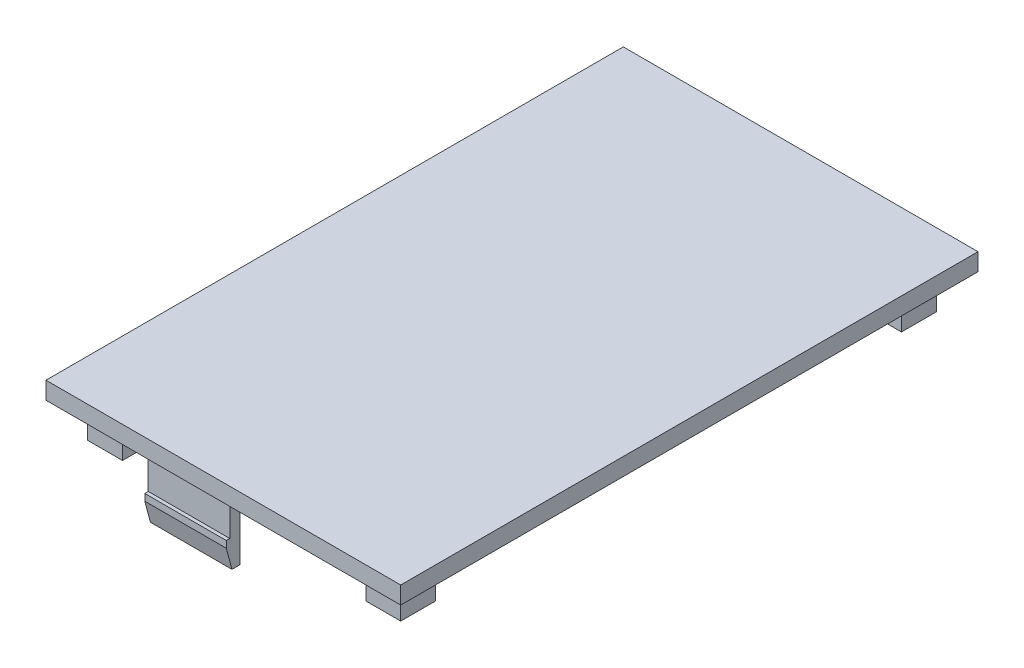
ISO-10303-21;
HEADER;
FILE_DESCRIPTION(('STEP AP214'),'2;1');
FILE_NAME('part.step','',(''),(''),'','','');
FILE_SCHEMA(('AUTOMOTIVE_DESIGN { 1 0 10303 214 1 1 1 1 }'));
ENDSEC;
DATA;
#1=APPLICATION_CONTEXT('core data for automotive mechanical design processes');
#2=APPLICATION_PROTOCOL_DEFINITION('international standard','automotive_design',2000,#1);
#3=PRODUCT_CONTEXT('',#1,'mechanical');
#4=PRODUCT('Part','Part','',(#3));
#5=PRODUCT_RELATED_PRODUCT_CATEGORY('part','',(#4));
#6=PRODUCT_DEFINITION_FORMATION('','',#4);
#7=PRODUCT_DEFINITION_CONTEXT('part definition',#1,'design');
#8=PRODUCT_DEFINITION('design','',#6,#7);
#9=PRODUCT_DEFINITION_SHAPE('','',#8);
#10=(LENGTH_UNIT() NAMED_UNIT(*) SI_UNIT(.MILLI.,.METRE.));
#11=(NAMED_UNIT(*) PLANE_ANGLE_UNIT() SI_UNIT($,.RADIAN.));
#12=(NAMED_UNIT(*) SI_UNIT($,.STERADIAN.) SOLID_ANGLE_UNIT());
#13=UNCERTAINTY_MEASURE_WITH_UNIT(LENGTH_MEASURE(1.E-05),#10,'distance_accuracy_value','');
#14=(GEOMETRIC_REPRESENTATION_CONTEXT(3) GLOBAL_UNCERTAINTY_ASSIGNED_CONTEXT((#13)) GLOBAL_UNIT_ASSIGNED_CONTEXT((#10,
#11,#12)) REPRESENTATION_CONTEXT('',''));
#15=CARTESIAN_POINT('',(0.,0.,0.));
#16=DIRECTION('',(0.,0.,1.));
#17=DIRECTION('',(1.,0.,0.));
#18=AXIS2_PLACEMENT_3D('',#15,#16,#17);
#19=CARTESIAN_POINT('',(0.,0.,0.));
#20=DIRECTION('',(0.,1.,0.));
#21=DIRECTION('',(0.,0.,1.));
#22=AXIS2_PLACEMENT_3D('',#19,#20,#21);
#23=PLANE('',#22);
#24=DIRECTION('',(1.,0.,0.));
#25=VECTOR('',#24,1.);
#26=CARTESIAN_POINT('',(-173.544647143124,0.,3.13950315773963));
#27=LINE('',#26,#25);
#28=CARTESIAN_POINT('',(-178.544647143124,0.,3.13950315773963));
#29=VERTEX_POINT('',#28);
#30=CARTESIAN_POINT('',(-173.544647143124,0.,3.13950315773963));
#31=VERTEX_POINT('',#30);
#32=EDGE_CURVE('E334',#29,#31,#27,.T.);
#33=ORIENTED_EDGE('',*,*,#32,.F.);
#34=DIRECTION('',(0.,0.,-1.));
#35=VECTOR('',#34,1.);
#36=CARTESIAN_POINT('',(-178.544647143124,0.,3.13950315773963));
#37=LINE('',#36,#35);
#38=CARTESIAN_POINT('',(-178.544647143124,0.,5.13950315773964));
#39=VERTEX_POINT('',#38);
#40=EDGE_CURVE('E347',#39,#29,#37,.T.);
#41=ORIENTED_EDGE('',*,*,#40,.F.);
#42=DIRECTION('',(-1.,0.,0.));
#43=VECTOR('',#42,1.);
#44=CARTESIAN_POINT('',(-178.544647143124,0.,5.13950315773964));
#45=LINE('',#44,#43);
#46=CARTESIAN_POINT('',(-175.544647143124,0.,5.13950315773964));
#47=VERTEX_POINT('',#46);
#48=EDGE_CURVE('E366',#47,#39,#45,.T.);
#49=ORIENTED_EDGE('',*,*,#48,.F.);
#50=DIRECTION('',(0.,0.,-1.));
#51=VECTOR('',#50,1.);
#52=CARTESIAN_POINT('',(-175.544647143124,0.,5.13950315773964));
#53=LINE('',#52,#51);
#54=CARTESIAN_POINT('',(-175.544647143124,0.,8.13950315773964));
#55=VERTEX_POINT('',#54);
#56=EDGE_CURVE('E363',#55,#47,#53,.T.);
#57=ORIENTED_EDGE('',*,*,#56,.F.);
#58=DIRECTION('',(-1.,0.,0.));
#59=VECTOR('',#58,1.);
#60=CARTESIAN_POINT('',(-175.544647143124,0.,8.13950315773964));
#61=LINE('',#60,#59);
#62=CARTESIAN_POINT('',(-173.544647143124,0.,8.13950315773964));
#63=VERTEX_POINT('',#62);
#64=EDGE_CURVE('E360',#63,#55,#61,.T.);
#65=ORIENTED_EDGE('',*,*,#64,.F.);
#66=DIRECTION('',(0.,0.,1.));
#67=VECTOR('',#66,1.);
#68=CARTESIAN_POINT('',(-173.544647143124,0.,8.13950315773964));
#69=LINE('',#68,#67);
#70=EDGE_CURVE('E337',#31,#63,#69,.T.);
#71=ORIENTED_EDGE('',*,*,#70,.F.);
#72=EDGE_LOOP('',(#33,#41,#49,#57,#65,#71));
#73=FACE_BOUND('',#72,.T.);
#74=DIRECTION('',(-1.,0.,0.));
#75=VECTOR('',#74,1.);
#76=CARTESIAN_POINT('',(-218.544647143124,0.,80.1395031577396));
#77=LINE('',#76,#75);
#78=CARTESIAN_POINT('',(-213.544647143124,0.,80.1395031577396));
#79=VERTEX_POINT('',#78);
#80=CARTESIAN_POINT('',(-218.544647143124,0.,80.1395031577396));
#81=VERTEX_POINT('',#80);
#82=EDGE_CURVE('E437',#79,#81,#77,.T.);
#83=ORIENTED_EDGE('',*,*,#82,.F.);
#84=DIRECTION('',(0.,0.,1.));
#85=VECTOR('',#84,1.);
#86=CARTESIAN_POINT('',(-213.544647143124,0.,80.1395031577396));
#87=LINE('',#86,#85);
#88=CARTESIAN_POINT('',(-213.544647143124,0.,78.1395031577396));
#89=VERTEX_POINT('',#88);
#90=EDGE_CURVE('E442',#89,#79,#87,.T.);
#91=ORIENTED_EDGE('',*,*,#90,.F.);
#92=DIRECTION('',(1.,0.,0.));
#93=VECTOR('',#92,1.);
#94=CARTESIAN_POINT('',(-213.544647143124,0.,78.1395031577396));
#95=LINE('',#94,#93);
#96=CARTESIAN_POINT('',(-216.544647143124,0.,78.1395031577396));
#97=VERTEX_POINT('',#96);
#98=EDGE_CURVE('E464',#97,#89,#95,.T.);
#99=ORIENTED_EDGE('',*,*,#98,.F.);
#100=DIRECTION('',(0.,0.,1.));
#101=VECTOR('',#100,1.);
#102=CARTESIAN_POINT('',(-216.544647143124,0.,78.1395031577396));
#103=LINE('',#102,#101);
#104=CARTESIAN_POINT('',(-216.544647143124,0.,75.1395031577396));
#105=VERTEX_POINT('',#104);
#106=EDGE_CURVE('E461',#105,#97,#103,.T.);
#107=ORIENTED_EDGE('',*,*,#106,.F.);
#108=DIRECTION('',(1.,0.,0.));
#109=VECTOR('',#108,1.);
#110=CARTESIAN_POINT('',(-216.544647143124,0.,75.1395031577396));
#111=LINE('',#110,#109);
#112=CARTESIAN_POINT('',(-218.544647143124,0.,75.1395031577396));
#113=VERTEX_POINT('',#112);
#114=EDGE_CURVE('E458',#113,#105,#111,.T.);
#115=ORIENTED_EDGE('',*,*,#114,.F.);
#116=DIRECTION('',(0.,0.,-1.));
#117=VECTOR('',#116,1.);
#118=CARTESIAN_POINT('',(-218.544647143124,0.,75.1395031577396));
#119=LINE('',#118,#117);
#120=EDGE_CURVE('E455',#81,#113,#119,.T.);
#121=ORIENTED_EDGE('',*,*,#120,.F.);
#122=EDGE_LOOP('',(#83,#91,#99,#107,#115,#121));
#123=FACE_BOUND('',#122,.T.);
#124=DIRECTION('',(0.,0.,-1.));
#125=VECTOR('',#124,1.);
#126=CARTESIAN_POINT('',(-198.120071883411,0.,83.1395031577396));
#127=LINE('',#126,#125);
#128=CARTESIAN_POINT('',(-198.120071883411,0.,80.1395031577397));
#129=VERTEX_POINT('',#128);
#130=CARTESIAN_POINT('',(-198.120071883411,0.,74.6395031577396));
#131=VERTEX_POINT('',#130);
#132=EDGE_CURVE('E490',#129,#131,#127,.T.);
#133=ORIENTED_EDGE('',*,*,#132,.T.);
#134=DIRECTION('',(-1.,0.,0.));
#135=VECTOR('',#134,1.);
#136=CARTESIAN_POINT('',(-158.014683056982,0.,74.6395031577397));
#137=LINE('',#136,#135);
#138=CARTESIAN_POINT('',(-209.845565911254,0.,74.6395031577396));
#139=VERTEX_POINT('',#138);
#140=EDGE_CURVE('E563',#131,#139,#137,.T.);
#141=ORIENTED_EDGE('',*,*,#140,.T.);
#142=DIRECTION('',(0.,0.,1.));
#143=VECTOR('',#142,1.);
#144=CARTESIAN_POINT('',(-209.845565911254,0.,83.1395031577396));
#145=LINE('',#144,#143);
#146=CARTESIAN_POINT('',(-209.845565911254,0.,80.1395031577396));
#147=VERTEX_POINT('',#146);
#148=EDGE_CURVE('E542',#139,#147,#145,.T.);
#149=ORIENTED_EDGE('',*,*,#148,.T.);
#150=DIRECTION('',(-1.,0.,0.));
#151=VECTOR('',#150,1.);
#152=CARTESIAN_POINT('',(-158.014683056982,0.,80.1395031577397));
#153=LINE('',#152,#151);
#154=EDGE_CURVE('E564',#129,#147,#153,.T.);
#155=ORIENTED_EDGE('',*,*,#154,.F.);
#156=EDGE_LOOP('',(#133,#141,#149,#155));
#157=FACE_BOUND('',#156,.T.);
#158=DIRECTION('',(-1.,0.,0.));
#159=VECTOR('',#158,1.);
#160=CARTESIAN_POINT('',(-158.014683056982,0.,8.63950315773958));
#161=LINE('',#160,#159);
#162=CARTESIAN_POINT('',(-198.120071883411,0.,8.63950315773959));
#163=VERTEX_POINT('',#162);
#164=CARTESIAN_POINT('',(-209.845565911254,0.,8.63950315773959));
#165=VERTEX_POINT('',#164);
#166=EDGE_CURVE('E580',#163,#165,#161,.T.);
#167=ORIENTED_EDGE('',*,*,#166,.F.);
#168=DIRECTION('',(0.,0.,-1.));
#169=VECTOR('',#168,1.);
#170=CARTESIAN_POINT('',(-198.120071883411,0.,0.139503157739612));
#171=LINE('',#170,#169);
#172=CARTESIAN_POINT('',(-198.120071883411,0.,3.13950315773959));
#173=VERTEX_POINT('',#172);
#174=EDGE_CURVE('E495',#163,#173,#171,.T.);
#175=ORIENTED_EDGE('',*,*,#174,.T.);
#176=DIRECTION('',(-1.,0.,0.));
#177=VECTOR('',#176,1.);
#178=CARTESIAN_POINT('',(-158.014683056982,0.,3.13950315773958));
#179=LINE('',#178,#177);
#180=CARTESIAN_POINT('',(-209.845565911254,0.,3.13950315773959));
#181=VERTEX_POINT('',#180);
#182=EDGE_CURVE('E566',#173,#181,#179,.T.);
#183=ORIENTED_EDGE('',*,*,#182,.T.);
#184=DIRECTION('',(0.,0.,1.));
#185=VECTOR('',#184,1.);
#186=CARTESIAN_POINT('',(-209.845565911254,0.,0.139503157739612));
#187=LINE('',#186,#185);
#188=EDGE_CURVE('E486',#181,#165,#187,.T.);
#189=ORIENTED_EDGE('',*,*,#188,.T.);
#190=EDGE_LOOP('',(#167,#175,#183,#189));
#191=FACE_BOUND('',#190,.T.);
#192=DIRECTION('',(0.,0.,1.));
#193=VECTOR('',#192,1.);
#194=CARTESIAN_POINT('',(-221.544647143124,0.,0.139503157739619));
#195=LINE('',#194,#193);
#196=CARTESIAN_POINT('',(-221.544647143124,0.,0.139503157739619));
#197=VERTEX_POINT('',#196);
#198=CARTESIAN_POINT('',(-221.544647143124,0.,83.1395031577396));
#199=VERTEX_POINT('',#198);
#200=EDGE_CURVE('E583',#197,#199,#195,.T.);
#201=ORIENTED_EDGE('',*,*,#200,.F.);
#202=DIRECTION('',(-1.,0.,0.));
#203=VECTOR('',#202,1.);
#204=CARTESIAN_POINT('',(-221.544647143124,0.,0.139503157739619));
#205=LINE('',#204,#203);
#206=CARTESIAN_POINT('',(-170.544647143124,0.,0.139503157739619));
#207=VERTEX_POINT('',#206);
#208=EDGE_CURVE('E608',#207,#197,#205,.T.);
#209=ORIENTED_EDGE('',*,*,#208,.F.);
#210=DIRECTION('',(0.,0.,-1.));
#211=VECTOR('',#210,1.);
#212=CARTESIAN_POINT('',(-170.544647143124,0.,0.139503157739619));
#213=LINE('',#212,#211);
#214=CARTESIAN_POINT('',(-170.544647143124,0.,83.1395031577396));
#215=VERTEX_POINT('',#214);
#216=EDGE_CURVE('E618',#215,#207,#213,.T.);
#217=ORIENTED_EDGE('',*,*,#216,.F.);
#218=DIRECTION('',(1.,0.,0.));
#219=VECTOR('',#218,1.);
#220=CARTESIAN_POINT('',(-221.544647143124,0.,83.1395031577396));
#221=LINE('',#220,#219);
#222=EDGE_CURVE('E616',#199,#215,#221,.T.);
#223=ORIENTED_EDGE('',*,*,#222,.F.);
#224=EDGE_LOOP('',(#201,#209,#217,#223));
#225=FACE_BOUND('',#224,.T.);
#226=DIRECTION('',(0.,0.,1.));
#227=VECTOR('',#226,1.);
#228=CARTESIAN_POINT('',(-173.544647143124,0.,75.1395031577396));
#229=LINE('',#228,#227);
#230=CARTESIAN_POINT('',(-173.544647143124,0.,75.1395031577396));
#231=VERTEX_POINT('',#230);
#232=CARTESIAN_POINT('',(-173.544647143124,0.,80.1395031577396));
#233=VERTEX_POINT('',#232);
#234=EDGE_CURVE('E388',#231,#233,#229,.T.);
#235=ORIENTED_EDGE('',*,*,#234,.F.);
#236=DIRECTION('',(1.,0.,0.));
#237=VECTOR('',#236,1.);
#238=CARTESIAN_POINT('',(-175.544647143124,0.,75.1395031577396));
#239=LINE('',#238,#237);
#240=CARTESIAN_POINT('',(-175.544647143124,0.,75.1395031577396));
#241=VERTEX_POINT('',#240);
#242=EDGE_CURVE('E393',#241,#231,#239,.T.);
#243=ORIENTED_EDGE('',*,*,#242,.F.);
#244=DIRECTION('',(0.,0.,-1.));
#245=VECTOR('',#244,1.);
#246=CARTESIAN_POINT('',(-175.544647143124,0.,78.1395031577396));
#247=LINE('',#246,#245);
#248=CARTESIAN_POINT('',(-175.544647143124,0.,78.1395031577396));
#249=VERTEX_POINT('',#248);
#250=EDGE_CURVE('E415',#249,#241,#247,.T.);
#251=ORIENTED_EDGE('',*,*,#250,.F.);
#252=DIRECTION('',(1.,0.,0.));
#253=VECTOR('',#252,1.);
#254=CARTESIAN_POINT('',(-178.544647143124,0.,78.1395031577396));
#255=LINE('',#254,#253);
#256=CARTESIAN_POINT('',(-178.544647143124,0.,78.1395031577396));
#257=VERTEX_POINT('',#256);
#258=EDGE_CURVE('E412',#257,#249,#255,.T.);
#259=ORIENTED_EDGE('',*,*,#258,.F.);
#260=DIRECTION('',(0.,0.,-1.));
#261=VECTOR('',#260,1.);
#262=CARTESIAN_POINT('',(-178.544647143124,0.,80.1395031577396));
#263=LINE('',#262,#261);
#264=CARTESIAN_POINT('',(-178.544647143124,0.,80.1395031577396));
#265=VERTEX_POINT('',#264);
#266=EDGE_CURVE('E409',#265,#257,#263,.T.);
#267=ORIENTED_EDGE('',*,*,#266,.F.);
#268=DIRECTION('',(-1.,0.,0.));
#269=VECTOR('',#268,1.);
#270=CARTESIAN_POINT('',(-173.544647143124,0.,80.1395031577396));
#271=LINE('',#270,#269);
#272=EDGE_CURVE('E406',#233,#265,#271,.T.);
#273=ORIENTED_EDGE('',*,*,#272,.F.);
#274=EDGE_LOOP('',(#235,#243,#251,#259,#267,#273));
#275=FACE_BOUND('',#274,.T.);
#276=DIRECTION('',(0.,0.,-1.));
#277=VECTOR('',#276,1.);
#278=CARTESIAN_POINT('',(-218.544647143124,0.,8.13950315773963));
#279=LINE('',#278,#277);
#280=CARTESIAN_POINT('',(-218.544647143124,0.,8.13950315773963));
#281=VERTEX_POINT('',#280);
#282=CARTESIAN_POINT('',(-218.544647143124,0.,3.13950315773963));
#283=VERTEX_POINT('',#282);
#284=EDGE_CURVE('E333',#281,#283,#279,.T.);
#285=ORIENTED_EDGE('',*,*,#284,.F.);
#286=DIRECTION('',(-1.,0.,0.));
#287=VECTOR('',#286,1.);
#288=CARTESIAN_POINT('',(-216.544647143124,0.,8.13950315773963));
#289=LINE('',#288,#287);
#290=CARTESIAN_POINT('',(-216.544647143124,0.,8.13950315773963));
#291=VERTEX_POINT('',#290);
#292=EDGE_CURVE('E330',#291,#281,#289,.T.);
#293=ORIENTED_EDGE('',*,*,#292,.F.);
#294=DIRECTION('',(0.,0.,1.));
#295=VECTOR('',#294,1.);
#296=CARTESIAN_POINT('',(-216.544647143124,0.,5.13950315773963));
#297=LINE('',#296,#295);
#298=CARTESIAN_POINT('',(-216.544647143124,0.,5.13950315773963));
#299=VERTEX_POINT('',#298);
#300=EDGE_CURVE('E1216',#299,#291,#297,.T.);
#301=ORIENTED_EDGE('',*,*,#300,.F.);
#302=DIRECTION('',(-1.,0.,0.));
#303=VECTOR('',#302,1.);
#304=CARTESIAN_POINT('',(-213.544647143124,0.,5.13950315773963));
#305=LINE('',#304,#303);
#306=CARTESIAN_POINT('',(-213.544647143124,0.,5.13950315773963));
#307=VERTEX_POINT('',#306);
#308=EDGE_CURVE('E1231',#307,#299,#305,.T.);
#309=ORIENTED_EDGE('',*,*,#308,.F.);
#310=DIRECTION('',(0.,0.,1.));
#311=VECTOR('',#310,1.);
#312=CARTESIAN_POINT('',(-213.544647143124,0.,3.13950315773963));
#313=LINE('',#312,#311);
#314=CARTESIAN_POINT('',(-213.544647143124,0.,3.13950315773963));
#315=VERTEX_POINT('',#314);
#316=EDGE_CURVE('E52',#315,#307,#313,.T.);
#317=ORIENTED_EDGE('',*,*,#316,.F.);
#318=DIRECTION('',(1.,0.,0.));
#319=VECTOR('',#318,1.);
#320=CARTESIAN_POINT('',(-218.544647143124,0.,3.13950315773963));
#321=LINE('',#320,#319);
#322=EDGE_CURVE('E47',#283,#315,#321,.T.);
#323=ORIENTED_EDGE('',*,*,#322,.F.);
#324=EDGE_LOOP('',(#285,#293,#301,#309,#317,#323));
#325=FACE_BOUND('',#324,.T.);
#326=ADVANCED_FACE('F32',(#73,#123,#157,#191,#225,#275,#325),#23,.F.);
#327=CARTESIAN_POINT('',(-221.544647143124,2.5,0.139503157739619));
#328=DIRECTION('',(1.,0.,0.));
#329=DIRECTION('',(0.,0.,-1.));
#330=AXIS2_PLACEMENT_3D('',#327,#328,#329);
#331=PLANE('',#330);
#332=ORIENTED_EDGE('',*,*,#200,.T.);
#333=DIRECTION('',(0.,-1.,0.));
#334=VECTOR('',#333,1.);
#335=CARTESIAN_POINT('',(-221.544647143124,2.5,83.1395031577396));
#336=LINE('',#335,#334);
#337=CARTESIAN_POINT('',(-221.544647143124,2.5,83.1395031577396));
#338=VERTEX_POINT('',#337);
#339=EDGE_CURVE('E629',#338,#199,#336,.T.);
#340=ORIENTED_EDGE('',*,*,#339,.F.);
#341=DIRECTION('',(0.,0.,1.));
#342=VECTOR('',#341,1.);
#343=CARTESIAN_POINT('',(-221.544647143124,2.5,0.139503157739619));
#344=LINE('',#343,#342);
#345=CARTESIAN_POINT('',(-221.544647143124,2.5,0.139503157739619));
#346=VERTEX_POINT('',#345);
#347=EDGE_CURVE('E604',#346,#338,#344,.T.);
#348=ORIENTED_EDGE('',*,*,#347,.F.);
#349=DIRECTION('',(0.,-1.,0.));
#350=VECTOR('',#349,1.);
#351=CARTESIAN_POINT('',(-221.544647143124,2.5,0.139503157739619));
#352=LINE('',#351,#350);
#353=EDGE_CURVE('E614',#346,#197,#352,.T.);
#354=ORIENTED_EDGE('',*,*,#353,.T.);
#355=EDGE_LOOP('',(#332,#340,#348,#354));
#356=FACE_BOUND('',#355,.T.);
#357=ADVANCED_FACE('F34',(#356),#331,.F.);
#358=CARTESIAN_POINT('',(-158.014683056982,-3.99999999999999,78.6395031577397));
#359=DIRECTION('',(0.,0.707106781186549,0.707106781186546));
#360=DIRECTION('',(0.,-0.707106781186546,0.707106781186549));
#361=AXIS2_PLACEMENT_3D('',#358,#359,#360);
#362=PLANE('',#361);
#363=DIRECTION('',(0.,0.707106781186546,-0.707106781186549));
#364=VECTOR('',#363,1.);
#365=CARTESIAN_POINT('',(-198.120071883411,-3.99999999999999,78.6395031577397));
#366=LINE('',#365,#364);
#367=CARTESIAN_POINT('',(-198.120071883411,-3.99999999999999,78.6395031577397));
#368=VERTEX_POINT('',#367);
#369=EDGE_CURVE('E540',#368,#131,#366,.T.);
#370=ORIENTED_EDGE('',*,*,#369,.F.);
#371=DIRECTION('',(-1.,0.,0.));
#372=VECTOR('',#371,1.);
#373=CARTESIAN_POINT('',(-158.014683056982,-3.99999999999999,78.6395031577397));
#374=LINE('',#373,#372);
#375=CARTESIAN_POINT('',(-209.845565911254,-3.99999999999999,78.6395031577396));
#376=VERTEX_POINT('',#375);
#377=EDGE_CURVE('E577',#368,#376,#374,.T.);
#378=ORIENTED_EDGE('',*,*,#377,.T.);
#379=DIRECTION('',(0.,-0.707106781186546,0.707106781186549));
#380=VECTOR('',#379,1.);
#381=CARTESIAN_POINT('',(-209.845565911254,-3.99999999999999,78.6395031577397));
#382=LINE('',#381,#380);
#383=EDGE_CURVE('E560',#139,#376,#382,.T.);
#384=ORIENTED_EDGE('',*,*,#383,.F.);
#385=ORIENTED_EDGE('',*,*,#140,.F.);
#386=EDGE_LOOP('',(#370,#378,#384,#385));
#387=FACE_BOUND('',#386,.T.);
#388=ADVANCED_FACE('F684',(#387),#362,.F.);
#389=CARTESIAN_POINT('',(-158.014683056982,-11.,78.6395031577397));
#390=DIRECTION('',(0.,0.,1.));
#391=DIRECTION('',(1.,0.,0.));
#392=AXIS2_PLACEMENT_3D('',#389,#390,#391);
#393=PLANE('',#392);
#394=DIRECTION('',(0.,1.,0.));
#395=VECTOR('',#394,1.);
#396=CARTESIAN_POINT('',(-198.120071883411,-11.,78.6395031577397));
#397=LINE('',#396,#395);
#398=CARTESIAN_POINT('',(-198.120071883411,-11.,78.6395031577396));
#399=VERTEX_POINT('',#398);
#400=EDGE_CURVE('E538',#399,#368,#397,.T.);
#401=ORIENTED_EDGE('',*,*,#400,.F.);
#402=DIRECTION('',(-1.,0.,0.));
#403=VECTOR('',#402,1.);
#404=CARTESIAN_POINT('',(-158.014683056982,-11.,78.6395031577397));
#405=LINE('',#404,#403);
#406=CARTESIAN_POINT('',(-209.845565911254,-11.,78.6395031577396));
#407=VERTEX_POINT('',#406);
#408=EDGE_CURVE('E575',#399,#407,#405,.T.);
#409=ORIENTED_EDGE('',*,*,#408,.T.);
#410=DIRECTION('',(0.,-1.,0.));
#411=VECTOR('',#410,1.);
#412=CARTESIAN_POINT('',(-209.845565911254,-11.,78.6395031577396));
#413=LINE('',#412,#411);
#414=EDGE_CURVE('E557',#376,#407,#413,.T.);
#415=ORIENTED_EDGE('',*,*,#414,.F.);
#416=ORIENTED_EDGE('',*,*,#377,.F.);
#417=EDGE_LOOP('',(#401,#409,#415,#416));
#418=FACE_BOUND('',#417,.T.);
#419=ADVANCED_FACE('F744',(#418),#393,.F.);
#420=CARTESIAN_POINT('',(-158.014683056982,-11.,79.8266034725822));
#421=DIRECTION('',(0.,1.,0.));
#422=DIRECTION('',(0.,0.,1.));
#423=AXIS2_PLACEMENT_3D('',#420,#421,#422);
#424=PLANE('',#423);
#425=DIRECTION('',(0.,0.,-1.));
#426=VECTOR('',#425,1.);
#427=CARTESIAN_POINT('',(-198.120071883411,-11.,83.1395031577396));
#428=LINE('',#427,#426);
#429=CARTESIAN_POINT('',(-198.120071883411,-11.,79.8266034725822));
#430=VERTEX_POINT('',#429);
#431=EDGE_CURVE('E487',#430,#399,#428,.T.);
#432=ORIENTED_EDGE('',*,*,#431,.F.);
#433=DIRECTION('',(-1.,0.,0.));
#434=VECTOR('',#433,1.);
#435=CARTESIAN_POINT('',(-158.014683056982,-11.,79.8266034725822));
#436=LINE('',#435,#434);
#437=CARTESIAN_POINT('',(-209.845565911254,-11.,79.8266034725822));
#438=VERTEX_POINT('',#437);
#439=EDGE_CURVE('E573',#430,#438,#436,.T.);
#440=ORIENTED_EDGE('',*,*,#439,.T.);
#441=DIRECTION('',(0.,0.,1.));
#442=VECTOR('',#441,1.);
#443=CARTESIAN_POINT('',(-209.845565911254,-11.,83.1395031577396));
#444=LINE('',#443,#442);
#445=EDGE_CURVE('E543',#407,#438,#444,.T.);
#446=ORIENTED_EDGE('',*,*,#445,.F.);
#447=ORIENTED_EDGE('',*,*,#408,.F.);
#448=EDGE_LOOP('',(#432,#440,#446,#447));
#449=FACE_BOUND('',#448,.T.);
#450=ADVANCED_FACE('F740',(#449),#424,.F.);
#451=CARTESIAN_POINT('',(-158.014683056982,-7.96621707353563,80.6395031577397));
#452=DIRECTION('',(0.,0.258819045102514,-0.96592582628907));
#453=DIRECTION('',(0.,0.96592582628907,0.258819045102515));
#454=AXIS2_PLACEMENT_3D('',#451,#452,#453);
#455=PLANE('',#454);
#456=DIRECTION('',(0.,-0.96592582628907,-0.258819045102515));
#457=VECTOR('',#456,1.);
#458=CARTESIAN_POINT('',(-198.120071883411,-7.96621707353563,80.6395031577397));
#459=LINE('',#458,#457);
#460=CARTESIAN_POINT('',(-198.120071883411,-7.96621707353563,80.6395031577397));
#461=VERTEX_POINT('',#460);
#462=EDGE_CURVE('E536',#461,#430,#459,.T.);
#463=ORIENTED_EDGE('',*,*,#462,.F.);
#464=DIRECTION('',(-1.,0.,0.));
#465=VECTOR('',#464,1.);
#466=CARTESIAN_POINT('',(-158.014683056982,-7.96621707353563,80.6395031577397));
#467=LINE('',#466,#465);
#468=CARTESIAN_POINT('',(-209.845565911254,-7.96621707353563,80.6395031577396));
#469=VERTEX_POINT('',#468);
#470=EDGE_CURVE('E571',#461,#469,#467,.T.);
#471=ORIENTED_EDGE('',*,*,#470,.T.);
#472=DIRECTION('',(0.,0.96592582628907,0.258819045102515));
#473=VECTOR('',#472,1.);
#474=CARTESIAN_POINT('',(-209.845565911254,-7.96621707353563,80.6395031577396));
#475=LINE('',#474,#473);
#476=EDGE_CURVE('E554',#438,#469,#475,.T.);
#477=ORIENTED_EDGE('',*,*,#476,.F.);
#478=ORIENTED_EDGE('',*,*,#439,.F.);
#479=EDGE_LOOP('',(#463,#471,#477,#478));
#480=FACE_BOUND('',#479,.T.);
#481=ADVANCED_FACE('F736',(#480),#455,.F.);
#482=CARTESIAN_POINT('',(-158.014683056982,-7.,80.6395031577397));
#483=DIRECTION('',(0.,0.,-1.));
#484=DIRECTION('',(-1.,0.,0.));
#485=AXIS2_PLACEMENT_3D('',#482,#483,#484);
#486=PLANE('',#485);
#487=DIRECTION('',(0.,-1.,0.));
#488=VECTOR('',#487,1.);
#489=CARTESIAN_POINT('',(-198.120071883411,-7.,80.6395031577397));
#490=LINE('',#489,#488);
#491=CARTESIAN_POINT('',(-198.120071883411,-7.,80.6395031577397));
#492=VERTEX_POINT('',#491);
#493=EDGE_CURVE('E534',#492,#461,#490,.T.);
#494=ORIENTED_EDGE('',*,*,#493,.F.);
#495=DIRECTION('',(-1.,0.,0.));
#496=VECTOR('',#495,1.);
#497=CARTESIAN_POINT('',(-158.014683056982,-7.,80.6395031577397));
#498=LINE('',#497,#496);
#499=CARTESIAN_POINT('',(-209.845565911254,-7.,80.6395031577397));
#500=VERTEX_POINT('',#499);
#501=EDGE_CURVE('E569',#492,#500,#498,.T.);
#502=ORIENTED_EDGE('',*,*,#501,.T.);
#503=DIRECTION('',(0.,1.,0.));
#504=VECTOR('',#503,1.);
#505=CARTESIAN_POINT('',(-209.845565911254,-7.,80.6395031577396));
#506=LINE('',#505,#504);
#507=EDGE_CURVE('E551',#469,#500,#506,.T.);
#508=ORIENTED_EDGE('',*,*,#507,.F.);
#509=ORIENTED_EDGE('',*,*,#470,.F.);
#510=EDGE_LOOP('',(#494,#502,#508,#509));
#511=FACE_BOUND('',#510,.T.);
#512=ADVANCED_FACE('F732',(#511),#486,.F.);
#513=CARTESIAN_POINT('',(-158.014683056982,-7.,80.1395031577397));
#514=DIRECTION('',(0.,-1.,0.));
#515=DIRECTION('',(0.,0.,-1.));
#516=AXIS2_PLACEMENT_3D('',#513,#514,#515);
#517=PLANE('',#516);
#518=DIRECTION('',(0.,0.,1.));
#519=VECTOR('',#518,1.);
#520=CARTESIAN_POINT('',(-198.120071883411,-7.,80.1395031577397));
#521=LINE('',#520,#519);
#522=CARTESIAN_POINT('',(-198.120071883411,-7.,80.1395031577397));
#523=VERTEX_POINT('',#522);
#524=EDGE_CURVE('E532',#523,#492,#521,.T.);
#525=ORIENTED_EDGE('',*,*,#524,.F.);
#526=DIRECTION('',(-1.,0.,0.));
#527=VECTOR('',#526,1.);
#528=CARTESIAN_POINT('',(-158.014683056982,-7.,80.1395031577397));
#529=LINE('',#528,#527);
#530=CARTESIAN_POINT('',(-209.845565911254,-7.,80.1395031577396));
#531=VERTEX_POINT('',#530);
#532=EDGE_CURVE('E567',#523,#531,#529,.T.);
#533=ORIENTED_EDGE('',*,*,#532,.T.);
#534=DIRECTION('',(0.,0.,-1.));
#535=VECTOR('',#534,1.);
#536=CARTESIAN_POINT('',(-209.845565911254,-7.,80.1395031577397));
#537=LINE('',#536,#535);
#538=EDGE_CURVE('E546',#500,#531,#537,.T.);
#539=ORIENTED_EDGE('',*,*,#538,.F.);
#540=ORIENTED_EDGE('',*,*,#501,.F.);
#541=EDGE_LOOP('',(#525,#533,#539,#540));
#542=FACE_BOUND('',#541,.T.);
#543=ADVANCED_FACE('F728',(#542),#517,.F.);
#544=CARTESIAN_POINT('',(-158.014683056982,0.,80.1395031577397));
#545=DIRECTION('',(0.,0.,-1.));
#546=DIRECTION('',(-1.,0.,0.));
#547=AXIS2_PLACEMENT_3D('',#544,#545,#546);
#548=PLANE('',#547);
#549=DIRECTION('',(0.,-1.,0.));
#550=VECTOR('',#549,1.);
#551=CARTESIAN_POINT('',(-198.120071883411,0.,80.1395031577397));
#552=LINE('',#551,#550);
#553=EDGE_CURVE('E530',#129,#523,#552,.T.);
#554=ORIENTED_EDGE('',*,*,#553,.F.);
#555=ORIENTED_EDGE('',*,*,#154,.T.);
#556=DIRECTION('',(0.,1.,0.));
#557=VECTOR('',#556,1.);
#558=CARTESIAN_POINT('',(-209.845565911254,0.,80.1395031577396));
#559=LINE('',#558,#557);
#560=EDGE_CURVE('E632',#531,#147,#559,.T.);
#561=ORIENTED_EDGE('',*,*,#560,.F.);
#562=ORIENTED_EDGE('',*,*,#532,.F.);
#563=EDGE_LOOP('',(#554,#555,#561,#562));
#564=FACE_BOUND('',#563,.T.);
#565=ADVANCED_FACE('F674',(#564),#548,.F.);
#566=CARTESIAN_POINT('',(-170.544647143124,2.5,0.139503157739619));
#567=DIRECTION('',(-1.,0.,0.));
#568=DIRECTION('',(0.,0.,1.));
#569=AXIS2_PLACEMENT_3D('',#566,#567,#568);
#570=PLANE('',#569);
#571=ORIENTED_EDGE('',*,*,#216,.T.);
#572=DIRECTION('',(0.,-1.,0.));
#573=VECTOR('',#572,1.);
#574=CARTESIAN_POINT('',(-170.544647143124,2.5,0.139503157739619));
#575=LINE('',#574,#573);
#576=CARTESIAN_POINT('',(-170.544647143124,2.5,0.139503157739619));
#577=VERTEX_POINT('',#576);
#578=EDGE_CURVE('E623',#577,#207,#575,.T.);
#579=ORIENTED_EDGE('',*,*,#578,.F.);
#580=DIRECTION('',(0.,0.,-1.));
#581=VECTOR('',#580,1.);
#582=CARTESIAN_POINT('',(-170.544647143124,2.5,0.139503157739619));
#583=LINE('',#582,#581);
#584=CARTESIAN_POINT('',(-170.544647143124,2.5,83.1395031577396));
#585=VERTEX_POINT('',#584);
#586=EDGE_CURVE('E610',#585,#577,#583,.T.);
#587=ORIENTED_EDGE('',*,*,#586,.F.);
#588=DIRECTION('',(0.,-1.,0.));
#589=VECTOR('',#588,1.);
#590=CARTESIAN_POINT('',(-170.544647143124,2.5,83.1395031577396));
#591=LINE('',#590,#589);
#592=EDGE_CURVE('E626',#585,#215,#591,.T.);
#593=ORIENTED_EDGE('',*,*,#592,.T.);
#594=EDGE_LOOP('',(#571,#579,#587,#593));
#595=FACE_BOUND('',#594,.T.);
#596=ADVANCED_FACE('F667',(#595),#570,.F.);
#597=CARTESIAN_POINT('',(-158.014683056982,-3.99999999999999,4.63950315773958));
#598=DIRECTION('',(0.,-0.707106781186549,0.707106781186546));
#599=DIRECTION('',(0.,-0.707106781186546,-0.707106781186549));
#600=AXIS2_PLACEMENT_3D('',#597,#598,#599);
#601=PLANE('',#600);
#602=DIRECTION('',(-1.,0.,0.));
#603=VECTOR('',#602,1.);
#604=CARTESIAN_POINT('',(-158.014683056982,-3.99999999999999,4.63950315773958));
#605=LINE('',#604,#603);
#606=CARTESIAN_POINT('',(-198.120071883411,-3.99999999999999,4.63950315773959));
#607=VERTEX_POINT('',#606);
#608=CARTESIAN_POINT('',(-209.845565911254,-3.99999999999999,4.63950315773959));
#609=VERTEX_POINT('',#608);
#610=EDGE_CURVE('E584',#607,#609,#605,.T.);
#611=ORIENTED_EDGE('',*,*,#610,.F.);
#612=DIRECTION('',(0.,0.707106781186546,0.707106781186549));
#613=VECTOR('',#612,1.);
#614=CARTESIAN_POINT('',(-198.120071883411,-3.99999999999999,4.63950315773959));
#615=LINE('',#614,#613);
#616=EDGE_CURVE('E527',#607,#163,#615,.T.);
#617=ORIENTED_EDGE('',*,*,#616,.T.);
#618=ORIENTED_EDGE('',*,*,#166,.T.);
#619=DIRECTION('',(0.,-0.707106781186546,-0.707106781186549));
#620=VECTOR('',#619,1.);
#621=CARTESIAN_POINT('',(-209.845565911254,-3.99999999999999,4.63950315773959));
#622=LINE('',#621,#620);
#623=EDGE_CURVE('E512',#165,#609,#622,.T.);
#624=ORIENTED_EDGE('',*,*,#623,.T.);
#625=EDGE_LOOP('',(#611,#617,#618,#624));
#626=FACE_BOUND('',#625,.T.);
#627=ADVANCED_FACE('F665',(#626),#601,.T.);
#628=CARTESIAN_POINT('',(-158.014683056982,-11.,4.63950315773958));
#629=DIRECTION('',(0.,0.,1.));
#630=DIRECTION('',(1.,0.,0.));
#631=AXIS2_PLACEMENT_3D('',#628,#629,#630);
#632=PLANE('',#631);
#633=DIRECTION('',(-1.,0.,0.));
#634=VECTOR('',#633,1.);
#635=CARTESIAN_POINT('',(-158.014683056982,-11.,4.63950315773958));
#636=LINE('',#635,#634);
#637=CARTESIAN_POINT('',(-198.120071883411,-11.,4.63950315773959));
#638=VERTEX_POINT('',#637);
#639=CARTESIAN_POINT('',(-209.845565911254,-11.,4.63950315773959));
#640=VERTEX_POINT('',#639);
#641=EDGE_CURVE('E587',#638,#640,#636,.T.);
#642=ORIENTED_EDGE('',*,*,#641,.F.);
#643=DIRECTION('',(0.,1.,0.));
#644=VECTOR('',#643,1.);
#645=CARTESIAN_POINT('',(-198.120071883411,-11.,4.63950315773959));
#646=LINE('',#645,#644);
#647=EDGE_CURVE('E524',#638,#607,#646,.T.);
#648=ORIENTED_EDGE('',*,*,#647,.T.);
#649=ORIENTED_EDGE('',*,*,#610,.T.);
#650=DIRECTION('',(0.,-1.,0.));
#651=VECTOR('',#650,1.);
#652=CARTESIAN_POINT('',(-209.845565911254,-11.,4.63950315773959));
#653=LINE('',#652,#651);
#654=EDGE_CURVE('E509',#609,#640,#653,.T.);
#655=ORIENTED_EDGE('',*,*,#654,.T.);
#656=EDGE_LOOP('',(#642,#648,#649,#655));
#657=FACE_BOUND('',#656,.T.);
#658=ADVANCED_FACE('F662',(#657),#632,.T.);
#659=CARTESIAN_POINT('',(-158.014683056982,-11.,3.45240284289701));
#660=DIRECTION('',(0.,-1.,0.));
#661=DIRECTION('',(0.,0.,-1.));
#662=AXIS2_PLACEMENT_3D('',#659,#660,#661);
#663=PLANE('',#662);
#664=DIRECTION('',(-1.,0.,0.));
#665=VECTOR('',#664,1.);
#666=CARTESIAN_POINT('',(-158.014683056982,-11.,3.45240284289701));
#667=LINE('',#666,#665);
#668=CARTESIAN_POINT('',(-198.120071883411,-11.,3.45240284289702));
#669=VERTEX_POINT('',#668);
#670=CARTESIAN_POINT('',(-209.845565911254,-11.,3.45240284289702));
#671=VERTEX_POINT('',#670);
#672=EDGE_CURVE('E590',#669,#671,#667,.T.);
#673=ORIENTED_EDGE('',*,*,#672,.F.);
#674=DIRECTION('',(0.,0.,-1.));
#675=VECTOR('',#674,1.);
#676=CARTESIAN_POINT('',(-198.120071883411,-11.,0.139503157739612));
#677=LINE('',#676,#675);
#678=EDGE_CURVE('E493',#638,#669,#677,.T.);
#679=ORIENTED_EDGE('',*,*,#678,.F.);
#680=ORIENTED_EDGE('',*,*,#641,.T.);
#681=DIRECTION('',(0.,0.,1.));
#682=VECTOR('',#681,1.);
#683=CARTESIAN_POINT('',(-209.845565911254,-11.,0.139503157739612));
#684=LINE('',#683,#682);
#685=EDGE_CURVE('E497',#671,#640,#684,.T.);
#686=ORIENTED_EDGE('',*,*,#685,.F.);
#687=EDGE_LOOP('',(#673,#679,#680,#686));
#688=FACE_BOUND('',#687,.T.);
#689=ADVANCED_FACE('F658',(#688),#663,.T.);
#690=CARTESIAN_POINT('',(-158.014683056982,-7.96621707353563,2.63950315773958));
#691=DIRECTION('',(0.,-0.258819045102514,-0.96592582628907));
#692=DIRECTION('',(0.,0.96592582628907,-0.258819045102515));
#693=AXIS2_PLACEMENT_3D('',#690,#691,#692);
#694=PLANE('',#693);
#695=DIRECTION('',(-1.,0.,0.));
#696=VECTOR('',#695,1.);
#697=CARTESIAN_POINT('',(-158.014683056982,-7.96621707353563,2.63950315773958));
#698=LINE('',#697,#696);
#699=CARTESIAN_POINT('',(-198.120071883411,-7.96621707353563,2.63950315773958));
#700=VERTEX_POINT('',#699);
#701=CARTESIAN_POINT('',(-209.845565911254,-7.96621707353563,2.63950315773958));
#702=VERTEX_POINT('',#701);
#703=EDGE_CURVE('E593',#700,#702,#698,.T.);
#704=ORIENTED_EDGE('',*,*,#703,.F.);
#705=DIRECTION('',(0.,-0.96592582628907,0.258819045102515));
#706=VECTOR('',#705,1.);
#707=CARTESIAN_POINT('',(-198.120071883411,-7.96621707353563,2.63950315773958));
#708=LINE('',#707,#706);
#709=EDGE_CURVE('E521',#700,#669,#708,.T.);
#710=ORIENTED_EDGE('',*,*,#709,.T.);
#711=ORIENTED_EDGE('',*,*,#672,.T.);
#712=DIRECTION('',(0.,0.96592582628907,-0.258819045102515));
#713=VECTOR('',#712,1.);
#714=CARTESIAN_POINT('',(-209.845565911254,-7.96621707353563,2.63950315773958));
#715=LINE('',#714,#713);
#716=EDGE_CURVE('E506',#671,#702,#715,.T.);
#717=ORIENTED_EDGE('',*,*,#716,.T.);
#718=EDGE_LOOP('',(#704,#710,#711,#717));
#719=FACE_BOUND('',#718,.T.);
#720=ADVANCED_FACE('F654',(#719),#694,.T.);
#721=CARTESIAN_POINT('',(-158.014683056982,-7.,2.63950315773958));
#722=DIRECTION('',(0.,0.,-1.));
#723=DIRECTION('',(-1.,0.,0.));
#724=AXIS2_PLACEMENT_3D('',#721,#722,#723);
#725=PLANE('',#724);
#726=DIRECTION('',(-1.,0.,0.));
#727=VECTOR('',#726,1.);
#728=CARTESIAN_POINT('',(-158.014683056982,-7.,2.63950315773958));
#729=LINE('',#728,#727);
#730=CARTESIAN_POINT('',(-198.120071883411,-7.,2.63950315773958));
#731=VERTEX_POINT('',#730);
#732=CARTESIAN_POINT('',(-209.845565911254,-7.,2.63950315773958));
#733=VERTEX_POINT('',#732);
#734=EDGE_CURVE('E596',#731,#733,#729,.T.);
#735=ORIENTED_EDGE('',*,*,#734,.F.);
#736=DIRECTION('',(0.,-1.,0.));
#737=VECTOR('',#736,1.);
#738=CARTESIAN_POINT('',(-198.120071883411,-7.,2.63950315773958));
#739=LINE('',#738,#737);
#740=EDGE_CURVE('E518',#731,#700,#739,.T.);
#741=ORIENTED_EDGE('',*,*,#740,.T.);
#742=ORIENTED_EDGE('',*,*,#703,.T.);
#743=DIRECTION('',(0.,1.,0.));
#744=VECTOR('',#743,1.);
#745=CARTESIAN_POINT('',(-209.845565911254,-7.,2.63950315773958));
#746=LINE('',#745,#744);
#747=EDGE_CURVE('E503',#702,#733,#746,.T.);
#748=ORIENTED_EDGE('',*,*,#747,.T.);
#749=EDGE_LOOP('',(#735,#741,#742,#748));
#750=FACE_BOUND('',#749,.T.);
#751=ADVANCED_FACE('F651',(#750),#725,.T.);
#752=CARTESIAN_POINT('',(-158.014683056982,-7.,3.13950315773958));
#753=DIRECTION('',(0.,1.,0.));
#754=DIRECTION('',(0.,0.,1.));
#755=AXIS2_PLACEMENT_3D('',#752,#753,#754);
#756=PLANE('',#755);
#757=DIRECTION('',(-1.,0.,0.));
#758=VECTOR('',#757,1.);
#759=CARTESIAN_POINT('',(-158.014683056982,-7.,3.13950315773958));
#760=LINE('',#759,#758);
#761=CARTESIAN_POINT('',(-198.120071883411,-7.,3.13950315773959));
#762=VERTEX_POINT('',#761);
#763=CARTESIAN_POINT('',(-209.845565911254,-7.,3.13950315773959));
#764=VERTEX_POINT('',#763);
#765=EDGE_CURVE('E599',#762,#764,#760,.T.);
#766=ORIENTED_EDGE('',*,*,#765,.F.);
#767=DIRECTION('',(0.,0.,-1.));
#768=VECTOR('',#767,1.);
#769=CARTESIAN_POINT('',(-198.120071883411,-7.,3.13950315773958));
#770=LINE('',#769,#768);
#771=EDGE_CURVE('E515',#762,#731,#770,.T.);
#772=ORIENTED_EDGE('',*,*,#771,.T.);
#773=ORIENTED_EDGE('',*,*,#734,.T.);
#774=DIRECTION('',(0.,0.,1.));
#775=VECTOR('',#774,1.);
#776=CARTESIAN_POINT('',(-209.845565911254,-7.,3.13950315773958));
#777=LINE('',#776,#775);
#778=EDGE_CURVE('E489',#733,#764,#777,.T.);
#779=ORIENTED_EDGE('',*,*,#778,.T.);
#780=EDGE_LOOP('',(#766,#772,#773,#779));
#781=FACE_BOUND('',#780,.T.);
#782=ADVANCED_FACE('F647',(#781),#756,.T.);
#783=CARTESIAN_POINT('',(-158.014683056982,0.,3.13950315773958));
#784=DIRECTION('',(0.,0.,-1.));
#785=DIRECTION('',(-1.,0.,0.));
#786=AXIS2_PLACEMENT_3D('',#783,#784,#785);
#787=PLANE('',#786);
#788=ORIENTED_EDGE('',*,*,#182,.F.);
#789=DIRECTION('',(0.,-1.,0.));
#790=VECTOR('',#789,1.);
#791=CARTESIAN_POINT('',(-198.120071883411,0.,3.13950315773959));
#792=LINE('',#791,#790);
#793=EDGE_CURVE('E11',#173,#762,#792,.T.);
#794=ORIENTED_EDGE('',*,*,#793,.T.);
#795=ORIENTED_EDGE('',*,*,#765,.T.);
#796=DIRECTION('',(0.,1.,0.));
#797=VECTOR('',#796,1.);
#798=CARTESIAN_POINT('',(-209.845565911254,0.,3.13950315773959));
#799=LINE('',#798,#797);
#800=EDGE_CURVE('E40',#764,#181,#799,.T.);
#801=ORIENTED_EDGE('',*,*,#800,.T.);
#802=EDGE_LOOP('',(#788,#794,#795,#801));
#803=FACE_BOUND('',#802,.T.);
#804=ADVANCED_FACE('F637',(#803),#787,.T.);
#805=CARTESIAN_POINT('',(-221.544647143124,2.5,83.1395031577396));
#806=DIRECTION('',(0.,0.,-1.));
#807=DIRECTION('',(-1.,0.,0.));
#808=AXIS2_PLACEMENT_3D('',#805,#806,#807);
#809=PLANE('',#808);
#810=ORIENTED_EDGE('',*,*,#222,.T.);
#811=ORIENTED_EDGE('',*,*,#592,.F.);
#812=DIRECTION('',(1.,0.,0.));
#813=VECTOR('',#812,1.);
#814=CARTESIAN_POINT('',(-221.544647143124,2.5,83.1395031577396));
#815=LINE('',#814,#813);
#816=EDGE_CURVE('E607',#338,#585,#815,.T.);
#817=ORIENTED_EDGE('',*,*,#816,.F.);
#818=ORIENTED_EDGE('',*,*,#339,.T.);
#819=EDGE_LOOP('',(#810,#811,#817,#818));
#820=FACE_BOUND('',#819,.T.);
#821=ADVANCED_FACE('F693',(#820),#809,.F.);
#822=CARTESIAN_POINT('',(-221.544647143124,2.5,0.139503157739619));
#823=DIRECTION('',(0.,0.,1.));
#824=DIRECTION('',(1.,0.,0.));
#825=AXIS2_PLACEMENT_3D('',#822,#823,#824);
#826=PLANE('',#825);
#827=ORIENTED_EDGE('',*,*,#208,.T.);
#828=ORIENTED_EDGE('',*,*,#353,.F.);
#829=DIRECTION('',(-1.,0.,0.));
#830=VECTOR('',#829,1.);
#831=CARTESIAN_POINT('',(-221.544647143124,2.5,0.139503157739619));
#832=LINE('',#831,#830);
#833=EDGE_CURVE('E612',#577,#346,#832,.T.);
#834=ORIENTED_EDGE('',*,*,#833,.F.);
#835=ORIENTED_EDGE('',*,*,#578,.T.);
#836=EDGE_LOOP('',(#827,#828,#834,#835));
#837=FACE_BOUND('',#836,.T.);
#838=ADVANCED_FACE('F691',(#837),#826,.F.);
#839=CARTESIAN_POINT('',(0.,2.5,0.));
#840=DIRECTION('',(0.,1.,0.));
#841=DIRECTION('',(0.,0.,1.));
#842=AXIS2_PLACEMENT_3D('',#839,#840,#841);
#843=PLANE('',#842);
#844=ORIENTED_EDGE('',*,*,#347,.T.);
#845=ORIENTED_EDGE('',*,*,#816,.T.);
#846=ORIENTED_EDGE('',*,*,#586,.T.);
#847=ORIENTED_EDGE('',*,*,#833,.T.);
#848=EDGE_LOOP('',(#844,#845,#846,#847));
#849=FACE_BOUND('',#848,.T.);
#850=ADVANCED_FACE('F689',(#849),#843,.T.);
#851=CARTESIAN_POINT('',(-209.845565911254,-11.,83.1395031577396));
#852=DIRECTION('',(-1.,0.,0.));
#853=DIRECTION('',(0.,0.,1.));
#854=AXIS2_PLACEMENT_3D('',#851,#852,#853);
#855=PLANE('',#854);
#856=ORIENTED_EDGE('',*,*,#383,.T.);
#857=ORIENTED_EDGE('',*,*,#414,.T.);
#858=ORIENTED_EDGE('',*,*,#445,.T.);
#859=ORIENTED_EDGE('',*,*,#476,.T.);
#860=ORIENTED_EDGE('',*,*,#507,.T.);
#861=ORIENTED_EDGE('',*,*,#538,.T.);
#862=ORIENTED_EDGE('',*,*,#560,.T.);
#863=ORIENTED_EDGE('',*,*,#148,.F.);
#864=EDGE_LOOP('',(#856,#857,#858,#859,#860,#861,#862,#863));
#865=FACE_BOUND('',#864,.T.);
#866=ADVANCED_FACE('F714',(#865),#855,.T.);
#867=CARTESIAN_POINT('',(-209.845565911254,-11.,0.139503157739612));
#868=DIRECTION('',(-1.,0.,0.));
#869=DIRECTION('',(0.,0.,1.));
#870=AXIS2_PLACEMENT_3D('',#867,#868,#869);
#871=PLANE('',#870);
#872=ORIENTED_EDGE('',*,*,#188,.F.);
#873=ORIENTED_EDGE('',*,*,#800,.F.);
#874=ORIENTED_EDGE('',*,*,#778,.F.);
#875=ORIENTED_EDGE('',*,*,#747,.F.);
#876=ORIENTED_EDGE('',*,*,#716,.F.);
#877=ORIENTED_EDGE('',*,*,#685,.T.);
#878=ORIENTED_EDGE('',*,*,#654,.F.);
#879=ORIENTED_EDGE('',*,*,#623,.F.);
#880=EDGE_LOOP('',(#872,#873,#874,#875,#876,#877,#878,#879));
#881=FACE_BOUND('',#880,.T.);
#882=ADVANCED_FACE('F649',(#881),#871,.T.);
#883=CARTESIAN_POINT('',(-198.120071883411,-11.,0.139503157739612));
#884=DIRECTION('',(1.,0.,0.));
#885=DIRECTION('',(0.,0.,-1.));
#886=AXIS2_PLACEMENT_3D('',#883,#884,#885);
#887=PLANE('',#886);
#888=ORIENTED_EDGE('',*,*,#647,.F.);
#889=ORIENTED_EDGE('',*,*,#678,.T.);
#890=ORIENTED_EDGE('',*,*,#709,.F.);
#891=ORIENTED_EDGE('',*,*,#740,.F.);
#892=ORIENTED_EDGE('',*,*,#771,.F.);
#893=ORIENTED_EDGE('',*,*,#793,.F.);
#894=ORIENTED_EDGE('',*,*,#174,.F.);
#895=ORIENTED_EDGE('',*,*,#616,.F.);
#896=EDGE_LOOP('',(#888,#889,#890,#891,#892,#893,#894,#895));
#897=FACE_BOUND('',#896,.T.);
#898=ADVANCED_FACE('F645',(#897),#887,.T.);
#899=CARTESIAN_POINT('',(-198.120071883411,-11.,83.1395031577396));
#900=DIRECTION('',(1.,0.,0.));
#901=DIRECTION('',(0.,0.,-1.));
#902=AXIS2_PLACEMENT_3D('',#899,#900,#901);
#903=PLANE('',#902);
#904=ORIENTED_EDGE('',*,*,#369,.T.);
#905=ORIENTED_EDGE('',*,*,#132,.F.);
#906=ORIENTED_EDGE('',*,*,#553,.T.);
#907=ORIENTED_EDGE('',*,*,#524,.T.);
#908=ORIENTED_EDGE('',*,*,#493,.T.);
#909=ORIENTED_EDGE('',*,*,#462,.T.);
#910=ORIENTED_EDGE('',*,*,#431,.T.);
#911=ORIENTED_EDGE('',*,*,#400,.T.);
#912=EDGE_LOOP('',(#904,#905,#906,#907,#908,#909,#910,#911));
#913=FACE_BOUND('',#912,.T.);
#914=ADVANCED_FACE('F777',(#913),#903,.T.);
#915=CARTESIAN_POINT('',(-218.544647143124,-5.,80.1395031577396));
#916=DIRECTION('',(0.,0.,-1.));
#917=DIRECTION('',(-1.,0.,0.));
#918=AXIS2_PLACEMENT_3D('',#915,#916,#917);
#919=PLANE('',#918);
#920=ORIENTED_EDGE('',*,*,#82,.T.);
#921=DIRECTION('',(0.,1.,0.));
#922=VECTOR('',#921,1.);
#923=CARTESIAN_POINT('',(-218.544647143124,-5.,80.1395031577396));
#924=LINE('',#923,#922);
#925=CARTESIAN_POINT('',(-218.544647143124,-5.,80.1395031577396));
#926=VERTEX_POINT('',#925);
#927=EDGE_CURVE('E483',#926,#81,#924,.T.);
#928=ORIENTED_EDGE('',*,*,#927,.F.);
#929=DIRECTION('',(-1.,0.,0.));
#930=VECTOR('',#929,1.);
#931=CARTESIAN_POINT('',(-218.544647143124,-5.,80.1395031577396));
#932=LINE('',#931,#930);
#933=CARTESIAN_POINT('',(-213.544647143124,-5.,80.1395031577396));
#934=VERTEX_POINT('',#933);
#935=EDGE_CURVE('E438',#934,#926,#932,.T.);
#936=ORIENTED_EDGE('',*,*,#935,.F.);
#937=DIRECTION('',(0.,1.,0.));
#938=VECTOR('',#937,1.);
#939=CARTESIAN_POINT('',(-213.544647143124,-5.,80.1395031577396));
#940=LINE('',#939,#938);
#941=EDGE_CURVE('E452',#934,#79,#940,.T.);
#942=ORIENTED_EDGE('',*,*,#941,.T.);
#943=EDGE_LOOP('',(#920,#928,#936,#942));
#944=FACE_BOUND('',#943,.T.);
#945=ADVANCED_FACE('F779',(#944),#919,.F.);
#946=CARTESIAN_POINT('',(-218.544647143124,-5.,75.1395031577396));
#947=DIRECTION('',(1.,0.,0.));
#948=DIRECTION('',(0.,0.,-1.));
#949=AXIS2_PLACEMENT_3D('',#946,#947,#948);
#950=PLANE('',#949);
#951=ORIENTED_EDGE('',*,*,#120,.T.);
#952=DIRECTION('',(0.,1.,0.));
#953=VECTOR('',#952,1.);
#954=CARTESIAN_POINT('',(-218.544647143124,-5.,75.1395031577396));
#955=LINE('',#954,#953);
#956=CARTESIAN_POINT('',(-218.544647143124,-5.,75.1395031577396));
#957=VERTEX_POINT('',#956);
#958=EDGE_CURVE('E480',#957,#113,#955,.T.);
#959=ORIENTED_EDGE('',*,*,#958,.F.);
#960=DIRECTION('',(0.,0.,-1.));
#961=VECTOR('',#960,1.);
#962=CARTESIAN_POINT('',(-218.544647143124,-5.,75.1395031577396));
#963=LINE('',#962,#961);
#964=EDGE_CURVE('E441',#926,#957,#963,.T.);
#965=ORIENTED_EDGE('',*,*,#964,.F.);
#966=ORIENTED_EDGE('',*,*,#927,.T.);
#967=EDGE_LOOP('',(#951,#959,#965,#966));
#968=FACE_BOUND('',#967,.T.);
#969=ADVANCED_FACE('F785',(#968),#950,.F.);
#970=CARTESIAN_POINT('',(-216.544647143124,-5.,75.1395031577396));
#971=DIRECTION('',(0.,0.,1.));
#972=DIRECTION('',(1.,0.,0.));
#973=AXIS2_PLACEMENT_3D('',#970,#971,#972);
#974=PLANE('',#973);
#975=ORIENTED_EDGE('',*,*,#114,.T.);
#976=DIRECTION('',(0.,1.,0.));
#977=VECTOR('',#976,1.);
#978=CARTESIAN_POINT('',(-216.544647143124,-5.,75.1395031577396));
#979=LINE('',#978,#977);
#980=CARTESIAN_POINT('',(-216.544647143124,-5.,75.1395031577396));
#981=VERTEX_POINT('',#980);
#982=EDGE_CURVE('E477',#981,#105,#979,.T.);
#983=ORIENTED_EDGE('',*,*,#982,.F.);
#984=DIRECTION('',(1.,0.,0.));
#985=VECTOR('',#984,1.);
#986=CARTESIAN_POINT('',(-216.544647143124,-5.,75.1395031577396));
#987=LINE('',#986,#985);
#988=EDGE_CURVE('E444',#957,#981,#987,.T.);
#989=ORIENTED_EDGE('',*,*,#988,.F.);
#990=ORIENTED_EDGE('',*,*,#958,.T.);
#991=EDGE_LOOP('',(#975,#983,#989,#990));
#992=FACE_BOUND('',#991,.T.);
#993=ADVANCED_FACE('F791',(#992),#974,.F.);
#994=CARTESIAN_POINT('',(-216.544647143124,-5.,78.1395031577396));
#995=DIRECTION('',(-1.,0.,0.));
#996=DIRECTION('',(0.,0.,1.));
#997=AXIS2_PLACEMENT_3D('',#994,#995,#996);
#998=PLANE('',#997);
#999=ORIENTED_EDGE('',*,*,#106,.T.);
#1000=DIRECTION('',(0.,1.,0.));
#1001=VECTOR('',#1000,1.);
#1002=CARTESIAN_POINT('',(-216.544647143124,-5.,78.1395031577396));
#1003=LINE('',#1002,#1001);
#1004=CARTESIAN_POINT('',(-216.544647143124,-5.,78.1395031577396));
#1005=VERTEX_POINT('',#1004);
#1006=EDGE_CURVE('E474',#1005,#97,#1003,.T.);
#1007=ORIENTED_EDGE('',*,*,#1006,.F.);
#1008=DIRECTION('',(0.,0.,1.));
#1009=VECTOR('',#1008,1.);
#1010=CARTESIAN_POINT('',(-216.544647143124,-5.,78.1395031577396));
#1011=LINE('',#1010,#1009);
#1012=EDGE_CURVE('E446',#981,#1005,#1011,.T.);
#1013=ORIENTED_EDGE('',*,*,#1012,.F.);
#1014=ORIENTED_EDGE('',*,*,#982,.T.);
#1015=EDGE_LOOP('',(#999,#1007,#1013,#1014));
#1016=FACE_BOUND('',#1015,.T.);
#1017=ADVANCED_FACE('F795',(#1016),#998,.F.);
#1018=CARTESIAN_POINT('',(-213.544647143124,-5.,78.1395031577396));
#1019=DIRECTION('',(0.,0.,1.));
#1020=DIRECTION('',(1.,0.,0.));
#1021=AXIS2_PLACEMENT_3D('',#1018,#1019,#1020);
#1022=PLANE('',#1021);
#1023=ORIENTED_EDGE('',*,*,#98,.T.);
#1024=DIRECTION('',(0.,1.,0.));
#1025=VECTOR('',#1024,1.);
#1026=CARTESIAN_POINT('',(-213.544647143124,-5.,78.1395031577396));
#1027=LINE('',#1026,#1025);
#1028=CARTESIAN_POINT('',(-213.544647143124,-5.,78.1395031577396));
#1029=VERTEX_POINT('',#1028);
#1030=EDGE_CURVE('E471',#1029,#89,#1027,.T.);
#1031=ORIENTED_EDGE('',*,*,#1030,.F.);
#1032=DIRECTION('',(1.,0.,0.));
#1033=VECTOR('',#1032,1.);
#1034=CARTESIAN_POINT('',(-213.544647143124,-5.,78.1395031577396));
#1035=LINE('',#1034,#1033);
#1036=EDGE_CURVE('E448',#1005,#1029,#1035,.T.);
#1037=ORIENTED_EDGE('',*,*,#1036,.F.);
#1038=ORIENTED_EDGE('',*,*,#1006,.T.);
#1039=EDGE_LOOP('',(#1023,#1031,#1037,#1038));
#1040=FACE_BOUND('',#1039,.T.);
#1041=ADVANCED_FACE('F799',(#1040),#1022,.F.);
#1042=CARTESIAN_POINT('',(-213.544647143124,-5.,80.1395031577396));
#1043=DIRECTION('',(-1.,0.,0.));
#1044=DIRECTION('',(0.,0.,1.));
#1045=AXIS2_PLACEMENT_3D('',#1042,#1043,#1044);
#1046=PLANE('',#1045);
#1047=ORIENTED_EDGE('',*,*,#90,.T.);
#1048=ORIENTED_EDGE('',*,*,#941,.F.);
#1049=DIRECTION('',(0.,0.,1.));
#1050=VECTOR('',#1049,1.);
#1051=CARTESIAN_POINT('',(-213.544647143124,-5.,80.1395031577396));
#1052=LINE('',#1051,#1050);
#1053=EDGE_CURVE('E450',#1029,#934,#1052,.T.);
#1054=ORIENTED_EDGE('',*,*,#1053,.F.);
#1055=ORIENTED_EDGE('',*,*,#1030,.T.);
#1056=EDGE_LOOP('',(#1047,#1048,#1054,#1055));
#1057=FACE_BOUND('',#1056,.T.);
#1058=ADVANCED_FACE('F803',(#1057),#1046,.F.);
#1059=CARTESIAN_POINT('',(0.,-5.,0.));
#1060=DIRECTION('',(0.,1.,0.));
#1061=DIRECTION('',(0.,0.,1.));
#1062=AXIS2_PLACEMENT_3D('',#1059,#1060,#1061);
#1063=PLANE('',#1062);
#1064=ORIENTED_EDGE('',*,*,#935,.T.);
#1065=ORIENTED_EDGE('',*,*,#964,.T.);
#1066=ORIENTED_EDGE('',*,*,#988,.T.);
#1067=ORIENTED_EDGE('',*,*,#1012,.T.);
#1068=ORIENTED_EDGE('',*,*,#1036,.T.);
#1069=ORIENTED_EDGE('',*,*,#1053,.T.);
#1070=EDGE_LOOP('',(#1064,#1065,#1066,#1067,#1068,#1069));
#1071=FACE_BOUND('',#1070,.T.);
#1072=ADVANCED_FACE('F807',(#1071),#1063,.F.);
#1073=CARTESIAN_POINT('',(-173.544647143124,-5.,75.1395031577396));
#1074=DIRECTION('',(-1.,0.,0.));
#1075=DIRECTION('',(0.,0.,1.));
#1076=AXIS2_PLACEMENT_3D('',#1073,#1074,#1075);
#1077=PLANE('',#1076);
#1078=ORIENTED_EDGE('',*,*,#234,.T.);
#1079=DIRECTION('',(0.,1.,0.));
#1080=VECTOR('',#1079,1.);
#1081=CARTESIAN_POINT('',(-173.544647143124,-5.,80.1395031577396));
#1082=LINE('',#1081,#1080);
#1083=CARTESIAN_POINT('',(-173.544647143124,-5.,80.1395031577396));
#1084=VERTEX_POINT('',#1083);
#1085=EDGE_CURVE('E434',#1084,#233,#1082,.T.);
#1086=ORIENTED_EDGE('',*,*,#1085,.F.);
#1087=DIRECTION('',(0.,0.,1.));
#1088=VECTOR('',#1087,1.);
#1089=CARTESIAN_POINT('',(-173.544647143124,-5.,75.1395031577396));
#1090=LINE('',#1089,#1088);
#1091=CARTESIAN_POINT('',(-173.544647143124,-5.,75.1395031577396));
#1092=VERTEX_POINT('',#1091);
#1093=EDGE_CURVE('E389',#1092,#1084,#1090,.T.);
#1094=ORIENTED_EDGE('',*,*,#1093,.F.);
#1095=DIRECTION('',(0.,1.,0.));
#1096=VECTOR('',#1095,1.);
#1097=CARTESIAN_POINT('',(-173.544647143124,-5.,75.1395031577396));
#1098=LINE('',#1097,#1096);
#1099=EDGE_CURVE('E403',#1092,#231,#1098,.T.);
#1100=ORIENTED_EDGE('',*,*,#1099,.T.);
#1101=EDGE_LOOP('',(#1078,#1086,#1094,#1100));
#1102=FACE_BOUND('',#1101,.T.);
#1103=ADVANCED_FACE('F811',(#1102),#1077,.F.);
#1104=CARTESIAN_POINT('',(-173.544647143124,-5.,80.1395031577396));
#1105=DIRECTION('',(0.,0.,-1.));
#1106=DIRECTION('',(-1.,0.,0.));
#1107=AXIS2_PLACEMENT_3D('',#1104,#1105,#1106);
#1108=PLANE('',#1107);
#1109=ORIENTED_EDGE('',*,*,#272,.T.);
#1110=DIRECTION('',(0.,1.,0.));
#1111=VECTOR('',#1110,1.);
#1112=CARTESIAN_POINT('',(-178.544647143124,-5.,80.1395031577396));
#1113=LINE('',#1112,#1111);
#1114=CARTESIAN_POINT('',(-178.544647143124,-5.,80.1395031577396));
#1115=VERTEX_POINT('',#1114);
#1116=EDGE_CURVE('E431',#1115,#265,#1113,.T.);
#1117=ORIENTED_EDGE('',*,*,#1116,.F.);
#1118=DIRECTION('',(-1.,0.,0.));
#1119=VECTOR('',#1118,1.);
#1120=CARTESIAN_POINT('',(-173.544647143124,-5.,80.1395031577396));
#1121=LINE('',#1120,#1119);
#1122=EDGE_CURVE('E392',#1084,#1115,#1121,.T.);
#1123=ORIENTED_EDGE('',*,*,#1122,.F.);
#1124=ORIENTED_EDGE('',*,*,#1085,.T.);
#1125=EDGE_LOOP('',(#1109,#1117,#1123,#1124));
#1126=FACE_BOUND('',#1125,.T.);
#1127=ADVANCED_FACE('F815',(#1126),#1108,.F.);
#1128=CARTESIAN_POINT('',(-178.544647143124,-5.,80.1395031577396));
#1129=DIRECTION('',(1.,0.,0.));
#1130=DIRECTION('',(0.,0.,-1.));
#1131=AXIS2_PLACEMENT_3D('',#1128,#1129,#1130);
#1132=PLANE('',#1131);
#1133=ORIENTED_EDGE('',*,*,#266,.T.);
#1134=DIRECTION('',(0.,1.,0.));
#1135=VECTOR('',#1134,1.);
#1136=CARTESIAN_POINT('',(-178.544647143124,-5.,78.1395031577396));
#1137=LINE('',#1136,#1135);
#1138=CARTESIAN_POINT('',(-178.544647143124,-5.,78.1395031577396));
#1139=VERTEX_POINT('',#1138);
#1140=EDGE_CURVE('E428',#1139,#257,#1137,.T.);
#1141=ORIENTED_EDGE('',*,*,#1140,.F.);
#1142=DIRECTION('',(0.,0.,-1.));
#1143=VECTOR('',#1142,1.);
#1144=CARTESIAN_POINT('',(-178.544647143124,-5.,80.1395031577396));
#1145=LINE('',#1144,#1143);
#1146=EDGE_CURVE('E395',#1115,#1139,#1145,.T.);
#1147=ORIENTED_EDGE('',*,*,#1146,.F.);
#1148=ORIENTED_EDGE('',*,*,#1116,.T.);
#1149=EDGE_LOOP('',(#1133,#1141,#1147,#1148));
#1150=FACE_BOUND('',#1149,.T.);
#1151=ADVANCED_FACE('F819',(#1150),#1132,.F.);
#1152=CARTESIAN_POINT('',(-178.544647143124,-5.,78.1395031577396));
#1153=DIRECTION('',(0.,0.,1.));
#1154=DIRECTION('',(1.,0.,0.));
#1155=AXIS2_PLACEMENT_3D('',#1152,#1153,#1154);
#1156=PLANE('',#1155);
#1157=ORIENTED_EDGE('',*,*,#258,.T.);
#1158=DIRECTION('',(0.,1.,0.));
#1159=VECTOR('',#1158,1.);
#1160=CARTESIAN_POINT('',(-175.544647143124,-5.,78.1395031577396));
#1161=LINE('',#1160,#1159);
#1162=CARTESIAN_POINT('',(-175.544647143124,-5.,78.1395031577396));
#1163=VERTEX_POINT('',#1162);
#1164=EDGE_CURVE('E425',#1163,#249,#1161,.T.);
#1165=ORIENTED_EDGE('',*,*,#1164,.F.);
#1166=DIRECTION('',(1.,0.,0.));
#1167=VECTOR('',#1166,1.);
#1168=CARTESIAN_POINT('',(-178.544647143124,-5.,78.1395031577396));
#1169=LINE('',#1168,#1167);
#1170=EDGE_CURVE('E397',#1139,#1163,#1169,.T.);
#1171=ORIENTED_EDGE('',*,*,#1170,.F.);
#1172=ORIENTED_EDGE('',*,*,#1140,.T.);
#1173=EDGE_LOOP('',(#1157,#1165,#1171,#1172));
#1174=FACE_BOUND('',#1173,.T.);
#1175=ADVANCED_FACE('F823',(#1174),#1156,.F.);
#1176=CARTESIAN_POINT('',(-175.544647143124,-5.,78.1395031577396));
#1177=DIRECTION('',(1.,0.,0.));
#1178=DIRECTION('',(0.,0.,-1.));
#1179=AXIS2_PLACEMENT_3D('',#1176,#1177,#1178);
#1180=PLANE('',#1179);
#1181=ORIENTED_EDGE('',*,*,#250,.T.);
#1182=DIRECTION('',(0.,1.,0.));
#1183=VECTOR('',#1182,1.);
#1184=CARTESIAN_POINT('',(-175.544647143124,-5.,75.1395031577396));
#1185=LINE('',#1184,#1183);
#1186=CARTESIAN_POINT('',(-175.544647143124,-5.,75.1395031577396));
#1187=VERTEX_POINT('',#1186);
#1188=EDGE_CURVE('E422',#1187,#241,#1185,.T.);
#1189=ORIENTED_EDGE('',*,*,#1188,.F.);
#1190=DIRECTION('',(0.,0.,-1.));
#1191=VECTOR('',#1190,1.);
#1192=CARTESIAN_POINT('',(-175.544647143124,-5.,78.1395031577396));
#1193=LINE('',#1192,#1191);
#1194=EDGE_CURVE('E399',#1163,#1187,#1193,.T.);
#1195=ORIENTED_EDGE('',*,*,#1194,.F.);
#1196=ORIENTED_EDGE('',*,*,#1164,.T.);
#1197=EDGE_LOOP('',(#1181,#1189,#1195,#1196));
#1198=FACE_BOUND('',#1197,.T.);
#1199=ADVANCED_FACE('F827',(#1198),#1180,.F.);
#1200=CARTESIAN_POINT('',(-175.544647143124,-5.,75.1395031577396));
#1201=DIRECTION('',(0.,0.,1.));
#1202=DIRECTION('',(1.,0.,0.));
#1203=AXIS2_PLACEMENT_3D('',#1200,#1201,#1202);
#1204=PLANE('',#1203);
#1205=ORIENTED_EDGE('',*,*,#242,.T.);
#1206=ORIENTED_EDGE('',*,*,#1099,.F.);
#1207=DIRECTION('',(1.,0.,0.));
#1208=VECTOR('',#1207,1.);
#1209=CARTESIAN_POINT('',(-175.544647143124,-5.,75.1395031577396));
#1210=LINE('',#1209,#1208);
#1211=EDGE_CURVE('E401',#1187,#1092,#1210,.T.);
#1212=ORIENTED_EDGE('',*,*,#1211,.F.);
#1213=ORIENTED_EDGE('',*,*,#1188,.T.);
#1214=EDGE_LOOP('',(#1205,#1206,#1212,#1213));
#1215=FACE_BOUND('',#1214,.T.);
#1216=ADVANCED_FACE('F831',(#1215),#1204,.F.);
#1217=CARTESIAN_POINT('',(0.,-5.,0.));
#1218=DIRECTION('',(0.,-1.,0.));
#1219=DIRECTION('',(0.,0.,-1.));
#1220=AXIS2_PLACEMENT_3D('',#1217,#1218,#1219);
#1221=PLANE('',#1220);
#1222=ORIENTED_EDGE('',*,*,#1093,.T.);
#1223=ORIENTED_EDGE('',*,*,#1122,.T.);
#1224=ORIENTED_EDGE('',*,*,#1146,.T.);
#1225=ORIENTED_EDGE('',*,*,#1170,.T.);
#1226=ORIENTED_EDGE('',*,*,#1194,.T.);
#1227=ORIENTED_EDGE('',*,*,#1211,.T.);
#1228=EDGE_LOOP('',(#1222,#1223,#1224,#1225,#1226,#1227));
#1229=FACE_BOUND('',#1228,.T.);
#1230=ADVANCED_FACE('F835',(#1229),#1221,.T.);
#1231=CARTESIAN_POINT('',(-173.544647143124,-5.,3.13950315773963));
#1232=DIRECTION('',(0.,0.,1.));
#1233=DIRECTION('',(1.,0.,0.));
#1234=AXIS2_PLACEMENT_3D('',#1231,#1232,#1233);
#1235=PLANE('',#1234);
#1236=ORIENTED_EDGE('',*,*,#32,.T.);
#1237=DIRECTION('',(0.,1.,0.));
#1238=VECTOR('',#1237,1.);
#1239=CARTESIAN_POINT('',(-173.544647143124,-5.,3.13950315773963));
#1240=LINE('',#1239,#1238);
#1241=CARTESIAN_POINT('',(-173.544647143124,-5.,3.13950315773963));
#1242=VERTEX_POINT('',#1241);
#1243=EDGE_CURVE('E385',#1242,#31,#1240,.T.);
#1244=ORIENTED_EDGE('',*,*,#1243,.F.);
#1245=DIRECTION('',(1.,0.,0.));
#1246=VECTOR('',#1245,1.);
#1247=CARTESIAN_POINT('',(-173.544647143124,-5.,3.13950315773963));
#1248=LINE('',#1247,#1246);
#1249=CARTESIAN_POINT('',(-178.544647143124,-5.,3.13950315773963));
#1250=VERTEX_POINT('',#1249);
#1251=EDGE_CURVE('E343',#1250,#1242,#1248,.T.);
#1252=ORIENTED_EDGE('',*,*,#1251,.F.);
#1253=DIRECTION('',(0.,1.,0.));
#1254=VECTOR('',#1253,1.);
#1255=CARTESIAN_POINT('',(-178.544647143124,-5.,3.13950315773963));
#1256=LINE('',#1255,#1254);
#1257=EDGE_CURVE('E356',#1250,#29,#1256,.T.);
#1258=ORIENTED_EDGE('',*,*,#1257,.T.);
#1259=EDGE_LOOP('',(#1236,#1244,#1252,#1258));
#1260=FACE_BOUND('',#1259,.T.);
#1261=ADVANCED_FACE('F839',(#1260),#1235,.F.);
#1262=CARTESIAN_POINT('',(-173.544647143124,-5.,8.13950315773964));
#1263=DIRECTION('',(-1.,0.,0.));
#1264=DIRECTION('',(0.,0.,1.));
#1265=AXIS2_PLACEMENT_3D('',#1262,#1263,#1264);
#1266=PLANE('',#1265);
#1267=ORIENTED_EDGE('',*,*,#70,.T.);
#1268=DIRECTION('',(0.,1.,0.));
#1269=VECTOR('',#1268,1.);
#1270=CARTESIAN_POINT('',(-173.544647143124,-5.,8.13950315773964));
#1271=LINE('',#1270,#1269);
#1272=CARTESIAN_POINT('',(-173.544647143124,-5.,8.13950315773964));
#1273=VERTEX_POINT('',#1272);
#1274=EDGE_CURVE('E382',#1273,#63,#1271,.T.);
#1275=ORIENTED_EDGE('',*,*,#1274,.F.);
#1276=DIRECTION('',(0.,0.,1.));
#1277=VECTOR('',#1276,1.);
#1278=CARTESIAN_POINT('',(-173.544647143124,-5.,8.13950315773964));
#1279=LINE('',#1278,#1277);
#1280=EDGE_CURVE('E346',#1242,#1273,#1279,.T.);
#1281=ORIENTED_EDGE('',*,*,#1280,.F.);
#1282=ORIENTED_EDGE('',*,*,#1243,.T.);
#1283=EDGE_LOOP('',(#1267,#1275,#1281,#1282));
#1284=FACE_BOUND('',#1283,.T.);
#1285=ADVANCED_FACE('F843',(#1284),#1266,.F.);
#1286=CARTESIAN_POINT('',(-175.544647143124,-5.,8.13950315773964));
#1287=DIRECTION('',(0.,0.,-1.));
#1288=DIRECTION('',(-1.,0.,0.));
#1289=AXIS2_PLACEMENT_3D('',#1286,#1287,#1288);
#1290=PLANE('',#1289);
#1291=ORIENTED_EDGE('',*,*,#64,.T.);
#1292=DIRECTION('',(0.,1.,0.));
#1293=VECTOR('',#1292,1.);
#1294=CARTESIAN_POINT('',(-175.544647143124,-5.,8.13950315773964));
#1295=LINE('',#1294,#1293);
#1296=CARTESIAN_POINT('',(-175.544647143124,-5.,8.13950315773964));
#1297=VERTEX_POINT('',#1296);
#1298=EDGE_CURVE('E379',#1297,#55,#1295,.T.);
#1299=ORIENTED_EDGE('',*,*,#1298,.F.);
#1300=DIRECTION('',(-1.,0.,0.));
#1301=VECTOR('',#1300,1.);
#1302=CARTESIAN_POINT('',(-175.544647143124,-5.,8.13950315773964));
#1303=LINE('',#1302,#1301);
#1304=EDGE_CURVE('E349',#1273,#1297,#1303,.T.);
#1305=ORIENTED_EDGE('',*,*,#1304,.F.);
#1306=ORIENTED_EDGE('',*,*,#1274,.T.);
#1307=EDGE_LOOP('',(#1291,#1299,#1305,#1306));
#1308=FACE_BOUND('',#1307,.T.);
#1309=ADVANCED_FACE('F847',(#1308),#1290,.F.);
#1310=CARTESIAN_POINT('',(-175.544647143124,-5.,5.13950315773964));
#1311=DIRECTION('',(1.,0.,0.));
#1312=DIRECTION('',(0.,0.,-1.));
#1313=AXIS2_PLACEMENT_3D('',#1310,#1311,#1312);
#1314=PLANE('',#1313);
#1315=ORIENTED_EDGE('',*,*,#56,.T.);
#1316=DIRECTION('',(0.,1.,0.));
#1317=VECTOR('',#1316,1.);
#1318=CARTESIAN_POINT('',(-175.544647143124,-5.,5.13950315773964));
#1319=LINE('',#1318,#1317);
#1320=CARTESIAN_POINT('',(-175.544647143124,-5.,5.13950315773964));
#1321=VERTEX_POINT('',#1320);
#1322=EDGE_CURVE('E376',#1321,#47,#1319,.T.);
#1323=ORIENTED_EDGE('',*,*,#1322,.F.);
#1324=DIRECTION('',(0.,0.,-1.));
#1325=VECTOR('',#1324,1.);
#1326=CARTESIAN_POINT('',(-175.544647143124,-5.,5.13950315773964));
#1327=LINE('',#1326,#1325);
#1328=EDGE_CURVE('E351',#1297,#1321,#1327,.T.);
#1329=ORIENTED_EDGE('',*,*,#1328,.F.);
#1330=ORIENTED_EDGE('',*,*,#1298,.T.);
#1331=EDGE_LOOP('',(#1315,#1323,#1329,#1330));
#1332=FACE_BOUND('',#1331,.T.);
#1333=ADVANCED_FACE('F851',(#1332),#1314,.F.);
#1334=CARTESIAN_POINT('',(-178.544647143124,-5.,5.13950315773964));
#1335=DIRECTION('',(0.,0.,-1.));
#1336=DIRECTION('',(-1.,0.,0.));
#1337=AXIS2_PLACEMENT_3D('',#1334,#1335,#1336);
#1338=PLANE('',#1337);
#1339=ORIENTED_EDGE('',*,*,#48,.T.);
#1340=DIRECTION('',(0.,1.,0.));
#1341=VECTOR('',#1340,1.);
#1342=CARTESIAN_POINT('',(-178.544647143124,-5.,5.13950315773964));
#1343=LINE('',#1342,#1341);
#1344=CARTESIAN_POINT('',(-178.544647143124,-5.,5.13950315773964));
#1345=VERTEX_POINT('',#1344);
#1346=EDGE_CURVE('E373',#1345,#39,#1343,.T.);
#1347=ORIENTED_EDGE('',*,*,#1346,.F.);
#1348=DIRECTION('',(-1.,0.,0.));
#1349=VECTOR('',#1348,1.);
#1350=CARTESIAN_POINT('',(-178.544647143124,-5.,5.13950315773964));
#1351=LINE('',#1350,#1349);
#1352=EDGE_CURVE('E353',#1321,#1345,#1351,.T.);
#1353=ORIENTED_EDGE('',*,*,#1352,.F.);
#1354=ORIENTED_EDGE('',*,*,#1322,.T.);
#1355=EDGE_LOOP('',(#1339,#1347,#1353,#1354));
#1356=FACE_BOUND('',#1355,.T.);
#1357=ADVANCED_FACE('F855',(#1356),#1338,.F.);
#1358=CARTESIAN_POINT('',(-178.544647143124,-5.,3.13950315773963));
#1359=DIRECTION('',(1.,0.,0.));
#1360=DIRECTION('',(0.,0.,-1.));
#1361=AXIS2_PLACEMENT_3D('',#1358,#1359,#1360);
#1362=PLANE('',#1361);
#1363=ORIENTED_EDGE('',*,*,#40,.T.);
#1364=ORIENTED_EDGE('',*,*,#1257,.F.);
#1365=DIRECTION('',(0.,0.,-1.));
#1366=VECTOR('',#1365,1.);
#1367=CARTESIAN_POINT('',(-178.544647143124,-5.,3.13950315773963));
#1368=LINE('',#1367,#1366);
#1369=EDGE_CURVE('E355',#1345,#1250,#1368,.T.);
#1370=ORIENTED_EDGE('',*,*,#1369,.F.);
#1371=ORIENTED_EDGE('',*,*,#1346,.T.);
#1372=EDGE_LOOP('',(#1363,#1364,#1370,#1371));
#1373=FACE_BOUND('',#1372,.T.);
#1374=ADVANCED_FACE('F859',(#1373),#1362,.F.);
#1375=CARTESIAN_POINT('',(0.,-5.,0.));
#1376=DIRECTION('',(0.,1.,0.));
#1377=DIRECTION('',(0.,0.,1.));
#1378=AXIS2_PLACEMENT_3D('',#1375,#1376,#1377);
#1379=PLANE('',#1378);
#1380=ORIENTED_EDGE('',*,*,#1251,.T.);
#1381=ORIENTED_EDGE('',*,*,#1280,.T.);
#1382=ORIENTED_EDGE('',*,*,#1304,.T.);
#1383=ORIENTED_EDGE('',*,*,#1328,.T.);
#1384=ORIENTED_EDGE('',*,*,#1352,.T.);
#1385=ORIENTED_EDGE('',*,*,#1369,.T.);
#1386=EDGE_LOOP('',(#1380,#1381,#1382,#1383,#1384,#1385));
#1387=FACE_BOUND('',#1386,.T.);
#1388=ADVANCED_FACE('F863',(#1387),#1379,.F.);
#1389=CARTESIAN_POINT('',(-218.544647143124,-5.,8.13950315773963));
#1390=DIRECTION('',(1.,0.,0.));
#1391=DIRECTION('',(0.,0.,-1.));
#1392=AXIS2_PLACEMENT_3D('',#1389,#1390,#1391);
#1393=PLANE('',#1392);
#1394=ORIENTED_EDGE('',*,*,#284,.T.);
#1395=DIRECTION('',(0.,1.,0.));
#1396=VECTOR('',#1395,1.);
#1397=CARTESIAN_POINT('',(-218.544647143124,-5.,3.13950315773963));
#1398=LINE('',#1397,#1396);
#1399=CARTESIAN_POINT('',(-218.544647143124,-5.,3.13950315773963));
#1400=VERTEX_POINT('',#1399);
#1401=EDGE_CURVE('E314',#1400,#283,#1398,.T.);
#1402=ORIENTED_EDGE('',*,*,#1401,.F.);
#1403=DIRECTION('',(0.,0.,-1.));
#1404=VECTOR('',#1403,1.);
#1405=CARTESIAN_POINT('',(-218.544647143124,-5.,8.13950315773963));
#1406=LINE('',#1405,#1404);
#1407=CARTESIAN_POINT('',(-218.544647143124,-5.,8.13950315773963));
#1408=VERTEX_POINT('',#1407);
#1409=EDGE_CURVE('E321',#1408,#1400,#1406,.T.);
#1410=ORIENTED_EDGE('',*,*,#1409,.F.);
#1411=DIRECTION('',(0.,1.,0.));
#1412=VECTOR('',#1411,1.);
#1413=CARTESIAN_POINT('',(-218.544647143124,-5.,8.13950315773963));
#1414=LINE('',#1413,#1412);
#1415=EDGE_CURVE('E1212',#1408,#281,#1414,.T.);
#1416=ORIENTED_EDGE('',*,*,#1415,.T.);
#1417=EDGE_LOOP('',(#1394,#1402,#1410,#1416));
#1418=FACE_BOUND('',#1417,.T.);
#1419=ADVANCED_FACE('F332',(#1418),#1393,.F.);
#1420=CARTESIAN_POINT('',(-218.544647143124,-5.,3.13950315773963));
#1421=DIRECTION('',(0.,0.,1.));
#1422=DIRECTION('',(1.,0.,0.));
#1423=AXIS2_PLACEMENT_3D('',#1420,#1421,#1422);
#1424=PLANE('',#1423);
#1425=ORIENTED_EDGE('',*,*,#322,.T.);
#1426=DIRECTION('',(0.,1.,0.));
#1427=VECTOR('',#1426,1.);
#1428=CARTESIAN_POINT('',(-213.544647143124,-5.,3.13950315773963));
#1429=LINE('',#1428,#1427);
#1430=CARTESIAN_POINT('',(-213.544647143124,-5.,3.13950315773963));
#1431=VERTEX_POINT('',#1430);
#1432=EDGE_CURVE('E317',#1431,#315,#1429,.T.);
#1433=ORIENTED_EDGE('',*,*,#1432,.F.);
#1434=DIRECTION('',(1.,0.,0.));
#1435=VECTOR('',#1434,1.);
#1436=CARTESIAN_POINT('',(-218.544647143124,-5.,3.13950315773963));
#1437=LINE('',#1436,#1435);
#1438=EDGE_CURVE('E310',#1400,#1431,#1437,.T.);
#1439=ORIENTED_EDGE('',*,*,#1438,.F.);
#1440=ORIENTED_EDGE('',*,*,#1401,.T.);
#1441=EDGE_LOOP('',(#1425,#1433,#1439,#1440));
#1442=FACE_BOUND('',#1441,.T.);
#1443=ADVANCED_FACE('F312',(#1442),#1424,.F.);
#1444=CARTESIAN_POINT('',(-213.544647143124,-5.,3.13950315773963));
#1445=DIRECTION('',(-1.,0.,0.));
#1446=DIRECTION('',(0.,0.,1.));
#1447=AXIS2_PLACEMENT_3D('',#1444,#1445,#1446);
#1448=PLANE('',#1447);
#1449=ORIENTED_EDGE('',*,*,#316,.T.);
#1450=DIRECTION('',(0.,1.,0.));
#1451=VECTOR('',#1450,1.);
#1452=CARTESIAN_POINT('',(-213.544647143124,-5.,5.13950315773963));
#1453=LINE('',#1452,#1451);
#1454=CARTESIAN_POINT('',(-213.544647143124,-5.,5.13950315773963));
#1455=VERTEX_POINT('',#1454);
#1456=EDGE_CURVE('E339',#1455,#307,#1453,.T.);
#1457=ORIENTED_EDGE('',*,*,#1456,.F.);
#1458=DIRECTION('',(0.,0.,1.));
#1459=VECTOR('',#1458,1.);
#1460=CARTESIAN_POINT('',(-213.544647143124,-5.,3.13950315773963));
#1461=LINE('',#1460,#1459);
#1462=EDGE_CURVE('E320',#1431,#1455,#1461,.T.);
#1463=ORIENTED_EDGE('',*,*,#1462,.F.);
#1464=ORIENTED_EDGE('',*,*,#1432,.T.);
#1465=EDGE_LOOP('',(#1449,#1457,#1463,#1464));
#1466=FACE_BOUND('',#1465,.T.);
#1467=ADVANCED_FACE('F872',(#1466),#1448,.F.);
#1468=CARTESIAN_POINT('',(-213.544647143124,-5.,5.13950315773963));
#1469=DIRECTION('',(0.,0.,-1.));
#1470=DIRECTION('',(-1.,0.,0.));
#1471=AXIS2_PLACEMENT_3D('',#1468,#1469,#1470);
#1472=PLANE('',#1471);
#1473=ORIENTED_EDGE('',*,*,#308,.T.);
#1474=DIRECTION('',(0.,1.,0.));
#1475=VECTOR('',#1474,1.);
#1476=CARTESIAN_POINT('',(-216.544647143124,-5.,5.13950315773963));
#1477=LINE('',#1476,#1475);
#1478=CARTESIAN_POINT('',(-216.544647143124,-5.,5.13950315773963));
#1479=VERTEX_POINT('',#1478);
#1480=EDGE_CURVE('E1219',#1479,#299,#1477,.T.);
#1481=ORIENTED_EDGE('',*,*,#1480,.F.);
#1482=DIRECTION('',(-1.,0.,0.));
#1483=VECTOR('',#1482,1.);
#1484=CARTESIAN_POINT('',(-213.544647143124,-5.,5.13950315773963));
#1485=LINE('',#1484,#1483);
#1486=EDGE_CURVE('E1232',#1455,#1479,#1485,.T.);
#1487=ORIENTED_EDGE('',*,*,#1486,.F.);
#1488=ORIENTED_EDGE('',*,*,#1456,.T.);
#1489=EDGE_LOOP('',(#1473,#1481,#1487,#1488));
#1490=FACE_BOUND('',#1489,.T.);
#1491=ADVANCED_FACE('F875',(#1490),#1472,.F.);
#1492=CARTESIAN_POINT('',(-216.544647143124,-5.,5.13950315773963));
#1493=DIRECTION('',(-1.,0.,0.));
#1494=DIRECTION('',(0.,0.,1.));
#1495=AXIS2_PLACEMENT_3D('',#1492,#1493,#1494);
#1496=PLANE('',#1495);
#1497=ORIENTED_EDGE('',*,*,#300,.T.);
#1498=DIRECTION('',(0.,1.,0.));
#1499=VECTOR('',#1498,1.);
#1500=CARTESIAN_POINT('',(-216.544647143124,-5.,8.13950315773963));
#1501=LINE('',#1500,#1499);
#1502=CARTESIAN_POINT('',(-216.544647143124,-5.,8.13950315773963));
#1503=VERTEX_POINT('',#1502);
#1504=EDGE_CURVE('E1214',#1503,#291,#1501,.T.);
#1505=ORIENTED_EDGE('',*,*,#1504,.F.);
#1506=DIRECTION('',(0.,0.,1.));
#1507=VECTOR('',#1506,1.);
#1508=CARTESIAN_POINT('',(-216.544647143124,-5.,5.13950315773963));
#1509=LINE('',#1508,#1507);
#1510=EDGE_CURVE('E1221',#1479,#1503,#1509,.T.);
#1511=ORIENTED_EDGE('',*,*,#1510,.F.);
#1512=ORIENTED_EDGE('',*,*,#1480,.T.);
#1513=EDGE_LOOP('',(#1497,#1505,#1511,#1512));
#1514=FACE_BOUND('',#1513,.T.);
#1515=ADVANCED_FACE('F879',(#1514),#1496,.F.);
#1516=CARTESIAN_POINT('',(-216.544647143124,-5.,8.13950315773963));
#1517=DIRECTION('',(0.,0.,-1.));
#1518=DIRECTION('',(-1.,0.,0.));
#1519=AXIS2_PLACEMENT_3D('',#1516,#1517,#1518);
#1520=PLANE('',#1519);
#1521=ORIENTED_EDGE('',*,*,#292,.T.);
#1522=ORIENTED_EDGE('',*,*,#1415,.F.);
#1523=DIRECTION('',(-1.,0.,0.));
#1524=VECTOR('',#1523,1.);
#1525=CARTESIAN_POINT('',(-216.544647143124,-5.,8.13950315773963));
#1526=LINE('',#1525,#1524);
#1527=EDGE_CURVE('E326',#1503,#1408,#1526,.T.);
#1528=ORIENTED_EDGE('',*,*,#1527,.F.);
#1529=ORIENTED_EDGE('',*,*,#1504,.T.);
#1530=EDGE_LOOP('',(#1521,#1522,#1528,#1529));
#1531=FACE_BOUND('',#1530,.T.);
#1532=ADVANCED_FACE('F883',(#1531),#1520,.F.);
#1533=CARTESIAN_POINT('',(0.,-5.,0.));
#1534=DIRECTION('',(0.,-1.,0.));
#1535=DIRECTION('',(0.,0.,-1.));
#1536=AXIS2_PLACEMENT_3D('',#1533,#1534,#1535);
#1537=PLANE('',#1536);
#1538=ORIENTED_EDGE('',*,*,#1409,.T.);
#1539=ORIENTED_EDGE('',*,*,#1438,.T.);
#1540=ORIENTED_EDGE('',*,*,#1462,.T.);
#1541=ORIENTED_EDGE('',*,*,#1486,.T.);
#1542=ORIENTED_EDGE('',*,*,#1510,.T.);
#1543=ORIENTED_EDGE('',*,*,#1527,.T.);
#1544=EDGE_LOOP('',(#1538,#1539,#1540,#1541,#1542,#1543));
#1545=FACE_BOUND('',#1544,.T.);
#1546=ADVANCED_FACE('F324',(#1545),#1537,.T.);
#1547=CLOSED_SHELL('',(#326,#357,#388,#419,#450,#481,#512,#543,#565,#596,#627,#658,#689,#720,
#751,#782,#804,#821,#838,#850,#866,#882,#898,#914,#945,#969,#993,#1017,#1041,#1058,#1072,#1103,
#1127,#1151,#1175,#1199,#1216,#1230,#1261,#1285,#1309,#1333,#1357,#1374,#1388,#1419,#1443,#1467,
#1491,#1515,#1532,#1546));
#1548=MANIFOLD_SOLID_BREP('B2',#1547);
#1549=ADVANCED_BREP_SHAPE_REPRESENTATION('',(#18,#1548),#14);
#1550=SHAPE_DEFINITION_REPRESENTATION(#9,#1549);
ENDSEC;
END-ISO-10303-21;
